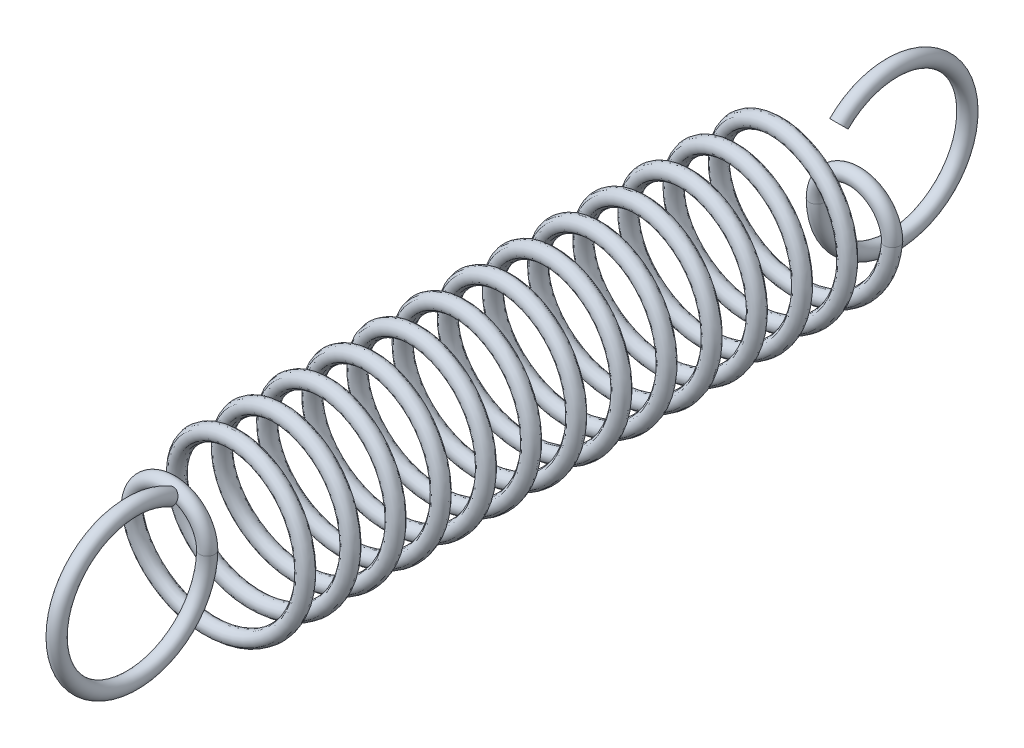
ISO-10303-21;
HEADER;
FILE_DESCRIPTION(('STEP AP214'),'2;1');
FILE_NAME('part.step','',(''),(''),'','','');
FILE_SCHEMA(('AUTOMOTIVE_DESIGN { 1 0 10303 214 1 1 1 1 }'));
ENDSEC;
DATA;
#1=APPLICATION_CONTEXT('core data for automotive mechanical design processes');
#2=APPLICATION_PROTOCOL_DEFINITION('international standard','automotive_design',2000,#1);
#3=PRODUCT_CONTEXT('',#1,'mechanical');
#4=PRODUCT('Part','Part','',(#3));
#5=PRODUCT_RELATED_PRODUCT_CATEGORY('part','',(#4));
#6=PRODUCT_DEFINITION_FORMATION('','',#4);
#7=PRODUCT_DEFINITION_CONTEXT('part definition',#1,'design');
#8=PRODUCT_DEFINITION('design','',#6,#7);
#9=PRODUCT_DEFINITION_SHAPE('','',#8);
#10=(LENGTH_UNIT() NAMED_UNIT(*) SI_UNIT(.MILLI.,.METRE.));
#11=(NAMED_UNIT(*) PLANE_ANGLE_UNIT() SI_UNIT($,.RADIAN.));
#12=(NAMED_UNIT(*) SI_UNIT($,.STERADIAN.) SOLID_ANGLE_UNIT());
#13=UNCERTAINTY_MEASURE_WITH_UNIT(LENGTH_MEASURE(1.E-05),#10,'distance_accuracy_value','');
#14=(GEOMETRIC_REPRESENTATION_CONTEXT(3) GLOBAL_UNCERTAINTY_ASSIGNED_CONTEXT((#13)) GLOBAL_UNIT_ASSIGNED_CONTEXT((#10,
#11,#12)) REPRESENTATION_CONTEXT('',''));
#15=CARTESIAN_POINT('',(0.,0.,0.));
#16=DIRECTION('',(0.,0.,1.));
#17=DIRECTION('',(1.,0.,0.));
#18=AXIS2_PLACEMENT_3D('',#15,#16,#17);
#19=CARTESIAN_POINT('',(4.99999999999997,0.,0.500000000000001));
#20=CARTESIAN_POINT('',(4.99999999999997,-2.88675134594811,0.75));
#21=CARTESIAN_POINT('',(2.49999999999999,-4.33012701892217,1.));
#22=CARTESIAN_POINT('',(0.,-5.77350269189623,1.25));
#23=CARTESIAN_POINT('',(-2.49999999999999,-4.33012701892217,1.5));
#24=CARTESIAN_POINT('',(-4.99999999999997,-2.88675134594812,1.75));
#25=CARTESIAN_POINT('',(-4.99999999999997,0.,2.));
#26=CARTESIAN_POINT('',(-4.99999999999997,2.88675134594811,2.25));
#27=CARTESIAN_POINT('',(-2.49999999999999,4.33012701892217,2.5));
#28=CARTESIAN_POINT('',(0.,5.77350269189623,2.75));
#29=CARTESIAN_POINT('',(2.49999999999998,4.33012701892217,2.99999999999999));
#30=CARTESIAN_POINT('',(4.99999999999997,2.88675134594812,3.24999999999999));
#31=CARTESIAN_POINT('',(4.99999999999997,0.,3.49999999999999));
#32=CARTESIAN_POINT('',(4.99999999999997,-2.88675134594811,3.74999999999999));
#33=CARTESIAN_POINT('',(2.49999999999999,-4.33012701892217,3.99999999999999));
#34=CARTESIAN_POINT('',(0.,-5.77350269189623,4.24999999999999));
#35=CARTESIAN_POINT('',(-2.49999999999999,-4.33012701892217,4.49999999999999));
#36=CARTESIAN_POINT('',(-4.99999999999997,-2.88675134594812,4.74999999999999));
#37=CARTESIAN_POINT('',(-4.99999999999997,0.,4.99999999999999));
#38=CARTESIAN_POINT('',(-4.99999999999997,2.88675134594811,5.24999999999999));
#39=CARTESIAN_POINT('',(-2.49999999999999,4.33012701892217,5.49999999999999));
#40=CARTESIAN_POINT('',(0.,5.77350269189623,5.74999999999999));
#41=CARTESIAN_POINT('',(2.49999999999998,4.33012701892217,5.99999999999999));
#42=CARTESIAN_POINT('',(4.99999999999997,2.88675134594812,6.24999999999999));
#43=CARTESIAN_POINT('',(4.99999999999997,0.,6.49999999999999));
#44=CARTESIAN_POINT('',(4.99999999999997,-2.88675134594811,6.74999999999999));
#45=CARTESIAN_POINT('',(2.49999999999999,-4.33012701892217,6.99999999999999));
#46=CARTESIAN_POINT('',(0.,-5.77350269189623,7.24999999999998));
#47=CARTESIAN_POINT('',(-2.49999999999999,-4.33012701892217,7.49999999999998));
#48=CARTESIAN_POINT('',(-4.99999999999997,-2.88675134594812,7.74999999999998));
#49=CARTESIAN_POINT('',(-4.99999999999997,0.,7.99999999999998));
#50=CARTESIAN_POINT('',(-4.99999999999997,2.88675134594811,8.24999999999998));
#51=CARTESIAN_POINT('',(-2.49999999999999,4.33012701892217,8.49999999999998));
#52=CARTESIAN_POINT('',(0.,5.77350269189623,8.74999999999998));
#53=CARTESIAN_POINT('',(2.49999999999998,4.33012701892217,8.99999999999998));
#54=CARTESIAN_POINT('',(4.99999999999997,2.88675134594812,9.24999999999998));
#55=CARTESIAN_POINT('',(4.99999999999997,0.,9.49999999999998));
#56=CARTESIAN_POINT('',(4.99999999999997,-2.88675134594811,9.74999999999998));
#57=CARTESIAN_POINT('',(2.49999999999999,-4.33012701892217,9.99999999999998));
#58=CARTESIAN_POINT('',(0.,-5.77350269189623,10.25));
#59=CARTESIAN_POINT('',(-2.49999999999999,-4.33012701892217,10.5));
#60=CARTESIAN_POINT('',(-4.99999999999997,-2.88675134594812,10.75));
#61=CARTESIAN_POINT('',(-4.99999999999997,0.,11.));
#62=CARTESIAN_POINT('',(-4.99999999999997,2.88675134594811,11.25));
#63=CARTESIAN_POINT('',(-2.49999999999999,4.33012701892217,11.5));
#64=CARTESIAN_POINT('',(0.,5.77350269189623,11.75));
#65=CARTESIAN_POINT('',(2.49999999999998,4.33012701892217,12.));
#66=CARTESIAN_POINT('',(4.99999999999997,2.88675134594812,12.25));
#67=CARTESIAN_POINT('',(4.99999999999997,0.,12.5));
#68=CARTESIAN_POINT('',(4.99999999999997,-2.88675134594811,12.75));
#69=CARTESIAN_POINT('',(2.49999999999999,-4.33012701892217,13.));
#70=CARTESIAN_POINT('',(0.,-5.77350269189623,13.25));
#71=CARTESIAN_POINT('',(-2.49999999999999,-4.33012701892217,13.5));
#72=CARTESIAN_POINT('',(-4.99999999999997,-2.88675134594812,13.75));
#73=CARTESIAN_POINT('',(-4.99999999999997,0.,14.));
#74=CARTESIAN_POINT('',(-4.99999999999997,2.88675134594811,14.25));
#75=CARTESIAN_POINT('',(-2.49999999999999,4.33012701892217,14.5));
#76=CARTESIAN_POINT('',(0.,5.77350269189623,14.75));
#77=CARTESIAN_POINT('',(2.49999999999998,4.33012701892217,15.));
#78=CARTESIAN_POINT('',(4.99999999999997,2.88675134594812,15.25));
#79=CARTESIAN_POINT('',(4.99999999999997,0.,15.5));
#80=CARTESIAN_POINT('',(4.99999999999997,-2.88675134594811,15.75));
#81=CARTESIAN_POINT('',(2.49999999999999,-4.33012701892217,16.));
#82=CARTESIAN_POINT('',(0.,-5.77350269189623,16.25));
#83=CARTESIAN_POINT('',(-2.49999999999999,-4.33012701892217,16.5));
#84=CARTESIAN_POINT('',(-4.99999999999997,-2.88675134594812,16.75));
#85=CARTESIAN_POINT('',(-4.99999999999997,0.,17.));
#86=CARTESIAN_POINT('',(-4.99999999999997,2.88675134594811,17.25));
#87=CARTESIAN_POINT('',(-2.49999999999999,4.33012701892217,17.5));
#88=CARTESIAN_POINT('',(0.,5.77350269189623,17.75));
#89=CARTESIAN_POINT('',(2.49999999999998,4.33012701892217,18.));
#90=CARTESIAN_POINT('',(4.99999999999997,2.88675134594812,18.25));
#91=CARTESIAN_POINT('',(4.99999999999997,0.,18.5));
#92=CARTESIAN_POINT('',(4.99999999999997,-2.88675134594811,18.75));
#93=CARTESIAN_POINT('',(2.49999999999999,-4.33012701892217,19.));
#94=CARTESIAN_POINT('',(0.,-5.77350269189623,19.25));
#95=CARTESIAN_POINT('',(-2.49999999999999,-4.33012701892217,19.5));
#96=CARTESIAN_POINT('',(-4.99999999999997,-2.88675134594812,19.75));
#97=CARTESIAN_POINT('',(-4.99999999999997,0.,20.));
#98=CARTESIAN_POINT('',(-4.99999999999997,2.88675134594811,20.25));
#99=CARTESIAN_POINT('',(-2.49999999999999,4.33012701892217,20.5));
#100=CARTESIAN_POINT('',(0.,5.77350269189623,20.75));
#101=CARTESIAN_POINT('',(2.49999999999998,4.33012701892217,21.));
#102=CARTESIAN_POINT('',(4.99999999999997,2.88675134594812,21.25));
#103=CARTESIAN_POINT('',(4.99999999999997,0.,21.5));
#104=CARTESIAN_POINT('',(4.99999999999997,-2.88675134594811,21.75));
#105=CARTESIAN_POINT('',(2.49999999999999,-4.33012701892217,22.));
#106=CARTESIAN_POINT('',(0.,-5.77350269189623,22.25));
#107=CARTESIAN_POINT('',(-2.49999999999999,-4.33012701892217,22.4999999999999));
#108=CARTESIAN_POINT('',(-4.99999999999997,-2.88675134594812,22.7499999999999));
#109=CARTESIAN_POINT('',(-4.99999999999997,0.,22.9999999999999));
#110=CARTESIAN_POINT('',(-4.99999999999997,2.88675134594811,23.2499999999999));
#111=CARTESIAN_POINT('',(-2.49999999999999,4.33012701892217,23.4999999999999));
#112=CARTESIAN_POINT('',(0.,5.77350269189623,23.7499999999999));
#113=CARTESIAN_POINT('',(2.49999999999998,4.33012701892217,23.9999999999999));
#114=CARTESIAN_POINT('',(4.99999999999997,2.88675134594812,24.2499999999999));
#115=CARTESIAN_POINT('',(4.99999999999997,0.,24.4999999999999));
#116=CARTESIAN_POINT('',(4.99999999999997,-2.88675134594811,24.7499999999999));
#117=CARTESIAN_POINT('',(2.49999999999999,-4.33012701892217,24.9999999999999));
#118=CARTESIAN_POINT('',(0.,-5.77350269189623,25.2499999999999));
#119=CARTESIAN_POINT('',(-2.49999999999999,-4.33012701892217,25.4999999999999));
#120=CARTESIAN_POINT('',(-4.99999999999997,-2.88675134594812,25.7499999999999));
#121=CARTESIAN_POINT('',(-4.99999999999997,0.,25.9999999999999));
#122=CARTESIAN_POINT('',(-4.99999999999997,2.88675134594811,26.2499999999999));
#123=CARTESIAN_POINT('',(-2.49999999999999,4.33012701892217,26.4999999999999));
#124=CARTESIAN_POINT('',(0.,5.77350269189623,26.7499999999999));
#125=CARTESIAN_POINT('',(2.49999999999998,4.33012701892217,26.9999999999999));
#126=CARTESIAN_POINT('',(4.99999999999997,2.88675134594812,27.2499999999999));
#127=CARTESIAN_POINT('',(4.99999999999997,0.,27.4999999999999));
#128=CARTESIAN_POINT('',(4.99999999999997,-2.88675134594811,27.7499999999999));
#129=CARTESIAN_POINT('',(2.49999999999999,-4.33012701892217,27.9999999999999));
#130=CARTESIAN_POINT('',(0.,-5.77350269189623,28.2499999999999));
#131=CARTESIAN_POINT('',(-2.49999999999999,-4.33012701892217,28.4999999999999));
#132=CARTESIAN_POINT('',(-4.99999999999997,-2.88675134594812,28.7499999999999));
#133=CARTESIAN_POINT('',(-4.99999999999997,0.,28.9999999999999));
#134=CARTESIAN_POINT('',(-4.99999999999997,2.88675134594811,29.2499999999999));
#135=CARTESIAN_POINT('',(-2.49999999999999,4.33012701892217,29.4999999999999));
#136=CARTESIAN_POINT('',(0.,5.77350269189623,29.7499999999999));
#137=CARTESIAN_POINT('',(2.49999999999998,4.33012701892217,29.9999999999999));
#138=CARTESIAN_POINT('',(4.99999999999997,2.88675134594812,30.2499999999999));
#139=CARTESIAN_POINT('',(4.99999999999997,0.,30.4999999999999));
#140=CARTESIAN_POINT('',(4.99999999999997,-2.88675134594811,30.7499999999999));
#141=CARTESIAN_POINT('',(2.49999999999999,-4.33012701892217,30.9999999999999));
#142=CARTESIAN_POINT('',(0.,-5.77350269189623,31.2499999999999));
#143=CARTESIAN_POINT('',(-2.49999999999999,-4.33012701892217,31.4999999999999));
#144=CARTESIAN_POINT('',(-4.99999999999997,-2.88675134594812,31.7499999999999));
#145=CARTESIAN_POINT('',(-4.99999999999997,0.,31.9999999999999));
#146=CARTESIAN_POINT('',(-4.99999999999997,2.88675134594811,32.2499999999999));
#147=CARTESIAN_POINT('',(-2.49999999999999,4.33012701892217,32.4999999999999));
#148=CARTESIAN_POINT('',(0.,5.77350269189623,32.7499999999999));
#149=CARTESIAN_POINT('',(2.49999999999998,4.33012701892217,32.9999999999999));
#150=CARTESIAN_POINT('',(4.99999999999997,2.88675134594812,33.2499999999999));
#151=CARTESIAN_POINT('',(4.99999999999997,0.,33.4999999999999));
#152=CARTESIAN_POINT('',(4.99999999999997,-2.88675134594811,33.7499999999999));
#153=CARTESIAN_POINT('',(2.49999999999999,-4.33012701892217,33.9999999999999));
#154=CARTESIAN_POINT('',(0.,-5.77350269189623,34.2499999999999));
#155=CARTESIAN_POINT('',(-2.49999999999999,-4.33012701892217,34.4999999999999));
#156=CARTESIAN_POINT('',(-4.99999999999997,-2.88675134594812,34.7499999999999));
#157=CARTESIAN_POINT('',(-4.99999999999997,0.,34.9999999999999));
#158=CARTESIAN_POINT('',(-4.99999999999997,2.88675134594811,35.2499999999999));
#159=CARTESIAN_POINT('',(-2.49999999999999,4.33012701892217,35.4999999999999));
#160=CARTESIAN_POINT('',(0.,5.77350269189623,35.7499999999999));
#161=CARTESIAN_POINT('',(2.49999999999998,4.33012701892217,35.9999999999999));
#162=CARTESIAN_POINT('',(4.99999999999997,2.88675134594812,36.2499999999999));
#163=CARTESIAN_POINT('',(4.99999999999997,0.,36.4999999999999));
#164=CARTESIAN_POINT('',(4.99999999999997,-2.88675134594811,36.7499999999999));
#165=CARTESIAN_POINT('',(2.49999999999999,-4.33012701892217,36.9999999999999));
#166=CARTESIAN_POINT('',(0.,-5.77350269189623,37.2499999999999));
#167=CARTESIAN_POINT('',(-2.49999999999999,-4.33012701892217,37.4999999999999));
#168=CARTESIAN_POINT('',(-4.99999999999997,-2.88675134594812,37.7499999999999));
#169=CARTESIAN_POINT('',(-4.99999999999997,0.,37.9999999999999));
#170=CARTESIAN_POINT('',(-4.99999999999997,2.88675134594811,38.2499999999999));
#171=CARTESIAN_POINT('',(-2.49999999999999,4.33012701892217,38.4999999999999));
#172=CARTESIAN_POINT('',(0.,5.77350269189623,38.7499999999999));
#173=CARTESIAN_POINT('',(2.49999999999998,4.33012701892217,38.9999999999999));
#174=CARTESIAN_POINT('',(4.99999999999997,2.88675134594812,39.2499999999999));
#175=CARTESIAN_POINT('',(4.99999999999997,0.,39.4999999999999));
#176=CARTESIAN_POINT('',(4.99999999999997,-2.88675134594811,39.7499999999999));
#177=CARTESIAN_POINT('',(2.49999999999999,-4.33012701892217,39.9999999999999));
#178=CARTESIAN_POINT('',(0.,-5.77350269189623,40.2499999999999));
#179=CARTESIAN_POINT('',(-2.49999999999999,-4.33012701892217,40.4999999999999));
#180=CARTESIAN_POINT('',(-4.99999999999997,-2.88675134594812,40.7499999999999));
#181=CARTESIAN_POINT('',(-4.99999999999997,0.,40.9999999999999));
#182=CARTESIAN_POINT('',(-4.99999999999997,2.88675134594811,41.2499999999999));
#183=CARTESIAN_POINT('',(-2.49999999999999,4.33012701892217,41.4999999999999));
#184=CARTESIAN_POINT('',(0.,5.77350269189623,41.7499999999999));
#185=CARTESIAN_POINT('',(2.49999999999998,4.33012701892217,41.9999999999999));
#186=CARTESIAN_POINT('',(4.99999999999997,2.88675134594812,42.2499999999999));
#187=CARTESIAN_POINT('',(4.99999999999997,0.,42.4999999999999));
#188=CARTESIAN_POINT('',(5.99999999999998,0.,0.500000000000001));
#189=CARTESIAN_POINT('',(5.99999999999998,-3.46410161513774,0.75));
#190=CARTESIAN_POINT('',(2.99999999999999,-5.19615242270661,1.));
#191=CARTESIAN_POINT('',(0.,-6.92820323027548,1.25));
#192=CARTESIAN_POINT('',(-2.99999999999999,-5.19615242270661,1.5));
#193=CARTESIAN_POINT('',(-5.99999999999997,-3.46410161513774,1.75));
#194=CARTESIAN_POINT('',(-5.99999999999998,0.,2.));
#195=CARTESIAN_POINT('',(-5.99999999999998,3.46410161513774,2.25));
#196=CARTESIAN_POINT('',(-2.99999999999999,5.19615242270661,2.5));
#197=CARTESIAN_POINT('',(0.,6.92820323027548,2.75));
#198=CARTESIAN_POINT('',(2.99999999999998,5.19615242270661,3.));
#199=CARTESIAN_POINT('',(5.99999999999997,3.46410161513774,3.24999999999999));
#200=CARTESIAN_POINT('',(5.99999999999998,0.,3.49999999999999));
#201=CARTESIAN_POINT('',(5.99999999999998,-3.46410161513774,3.74999999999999));
#202=CARTESIAN_POINT('',(2.99999999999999,-5.19615242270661,3.99999999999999));
#203=CARTESIAN_POINT('',(0.,-6.92820323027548,4.24999999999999));
#204=CARTESIAN_POINT('',(-2.99999999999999,-5.19615242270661,4.49999999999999));
#205=CARTESIAN_POINT('',(-5.99999999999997,-3.46410161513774,4.74999999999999));
#206=CARTESIAN_POINT('',(-5.99999999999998,0.,4.99999999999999));
#207=CARTESIAN_POINT('',(-5.99999999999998,3.46410161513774,5.24999999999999));
#208=CARTESIAN_POINT('',(-2.99999999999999,5.19615242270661,5.49999999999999));
#209=CARTESIAN_POINT('',(0.,6.92820323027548,5.74999999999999));
#210=CARTESIAN_POINT('',(2.99999999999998,5.19615242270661,5.99999999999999));
#211=CARTESIAN_POINT('',(5.99999999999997,3.46410161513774,6.24999999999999));
#212=CARTESIAN_POINT('',(5.99999999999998,0.,6.49999999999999));
#213=CARTESIAN_POINT('',(5.99999999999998,-3.46410161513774,6.74999999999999));
#214=CARTESIAN_POINT('',(2.99999999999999,-5.19615242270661,6.99999999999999));
#215=CARTESIAN_POINT('',(0.,-6.92820323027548,7.24999999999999));
#216=CARTESIAN_POINT('',(-2.99999999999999,-5.19615242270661,7.49999999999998));
#217=CARTESIAN_POINT('',(-5.99999999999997,-3.46410161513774,7.74999999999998));
#218=CARTESIAN_POINT('',(-5.99999999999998,0.,7.99999999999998));
#219=CARTESIAN_POINT('',(-5.99999999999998,3.46410161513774,8.24999999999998));
#220=CARTESIAN_POINT('',(-2.99999999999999,5.19615242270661,8.49999999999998));
#221=CARTESIAN_POINT('',(0.,6.92820323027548,8.74999999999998));
#222=CARTESIAN_POINT('',(2.99999999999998,5.19615242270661,8.99999999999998));
#223=CARTESIAN_POINT('',(5.99999999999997,3.46410161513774,9.24999999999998));
#224=CARTESIAN_POINT('',(5.99999999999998,0.,9.49999999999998));
#225=CARTESIAN_POINT('',(5.99999999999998,-3.46410161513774,9.74999999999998));
#226=CARTESIAN_POINT('',(2.99999999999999,-5.19615242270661,9.99999999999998));
#227=CARTESIAN_POINT('',(0.,-6.92820323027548,10.25));
#228=CARTESIAN_POINT('',(-2.99999999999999,-5.19615242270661,10.5));
#229=CARTESIAN_POINT('',(-5.99999999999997,-3.46410161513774,10.75));
#230=CARTESIAN_POINT('',(-5.99999999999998,0.,11.));
#231=CARTESIAN_POINT('',(-5.99999999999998,3.46410161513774,11.25));
#232=CARTESIAN_POINT('',(-2.99999999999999,5.19615242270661,11.5));
#233=CARTESIAN_POINT('',(0.,6.92820323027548,11.75));
#234=CARTESIAN_POINT('',(2.99999999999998,5.19615242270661,12.));
#235=CARTESIAN_POINT('',(5.99999999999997,3.46410161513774,12.25));
#236=CARTESIAN_POINT('',(5.99999999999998,0.,12.5));
#237=CARTESIAN_POINT('',(5.99999999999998,-3.46410161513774,12.75));
#238=CARTESIAN_POINT('',(2.99999999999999,-5.19615242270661,13.));
#239=CARTESIAN_POINT('',(0.,-6.92820323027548,13.25));
#240=CARTESIAN_POINT('',(-2.99999999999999,-5.19615242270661,13.5));
#241=CARTESIAN_POINT('',(-5.99999999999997,-3.46410161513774,13.75));
#242=CARTESIAN_POINT('',(-5.99999999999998,0.,14.));
#243=CARTESIAN_POINT('',(-5.99999999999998,3.46410161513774,14.25));
#244=CARTESIAN_POINT('',(-2.99999999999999,5.19615242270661,14.5));
#245=CARTESIAN_POINT('',(0.,6.92820323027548,14.75));
#246=CARTESIAN_POINT('',(2.99999999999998,5.19615242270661,15.));
#247=CARTESIAN_POINT('',(5.99999999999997,3.46410161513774,15.25));
#248=CARTESIAN_POINT('',(5.99999999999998,0.,15.5));
#249=CARTESIAN_POINT('',(5.99999999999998,-3.46410161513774,15.75));
#250=CARTESIAN_POINT('',(2.99999999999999,-5.19615242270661,16.));
#251=CARTESIAN_POINT('',(0.,-6.92820323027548,16.25));
#252=CARTESIAN_POINT('',(-2.99999999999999,-5.19615242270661,16.5));
#253=CARTESIAN_POINT('',(-5.99999999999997,-3.46410161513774,16.75));
#254=CARTESIAN_POINT('',(-5.99999999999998,0.,17.));
#255=CARTESIAN_POINT('',(-5.99999999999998,3.46410161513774,17.25));
#256=CARTESIAN_POINT('',(-2.99999999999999,5.19615242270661,17.5));
#257=CARTESIAN_POINT('',(0.,6.92820323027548,17.75));
#258=CARTESIAN_POINT('',(2.99999999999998,5.19615242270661,18.));
#259=CARTESIAN_POINT('',(5.99999999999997,3.46410161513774,18.25));
#260=CARTESIAN_POINT('',(5.99999999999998,0.,18.5));
#261=CARTESIAN_POINT('',(5.99999999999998,-3.46410161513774,18.75));
#262=CARTESIAN_POINT('',(2.99999999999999,-5.19615242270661,19.));
#263=CARTESIAN_POINT('',(0.,-6.92820323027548,19.25));
#264=CARTESIAN_POINT('',(-2.99999999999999,-5.19615242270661,19.5));
#265=CARTESIAN_POINT('',(-5.99999999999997,-3.46410161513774,19.75));
#266=CARTESIAN_POINT('',(-5.99999999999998,0.,20.));
#267=CARTESIAN_POINT('',(-5.99999999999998,3.46410161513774,20.25));
#268=CARTESIAN_POINT('',(-2.99999999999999,5.19615242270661,20.5));
#269=CARTESIAN_POINT('',(0.,6.92820323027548,20.75));
#270=CARTESIAN_POINT('',(2.99999999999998,5.19615242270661,21.));
#271=CARTESIAN_POINT('',(5.99999999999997,3.46410161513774,21.25));
#272=CARTESIAN_POINT('',(5.99999999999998,0.,21.5));
#273=CARTESIAN_POINT('',(5.99999999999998,-3.46410161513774,21.75));
#274=CARTESIAN_POINT('',(2.99999999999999,-5.19615242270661,22.));
#275=CARTESIAN_POINT('',(0.,-6.92820323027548,22.25));
#276=CARTESIAN_POINT('',(-2.99999999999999,-5.19615242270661,22.4999999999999));
#277=CARTESIAN_POINT('',(-5.99999999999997,-3.46410161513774,22.75));
#278=CARTESIAN_POINT('',(-5.99999999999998,0.,22.9999999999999));
#279=CARTESIAN_POINT('',(-5.99999999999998,3.46410161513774,23.25));
#280=CARTESIAN_POINT('',(-2.99999999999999,5.19615242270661,23.4999999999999));
#281=CARTESIAN_POINT('',(0.,6.92820323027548,23.7499999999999));
#282=CARTESIAN_POINT('',(2.99999999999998,5.19615242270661,23.9999999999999));
#283=CARTESIAN_POINT('',(5.99999999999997,3.46410161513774,24.2499999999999));
#284=CARTESIAN_POINT('',(5.99999999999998,0.,24.5));
#285=CARTESIAN_POINT('',(5.99999999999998,-3.46410161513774,24.7499999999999));
#286=CARTESIAN_POINT('',(2.99999999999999,-5.19615242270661,24.9999999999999));
#287=CARTESIAN_POINT('',(0.,-6.92820323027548,25.2499999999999));
#288=CARTESIAN_POINT('',(-2.99999999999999,-5.19615242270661,25.4999999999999));
#289=CARTESIAN_POINT('',(-5.99999999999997,-3.46410161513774,25.7499999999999));
#290=CARTESIAN_POINT('',(-5.99999999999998,0.,25.9999999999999));
#291=CARTESIAN_POINT('',(-5.99999999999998,3.46410161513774,26.2499999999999));
#292=CARTESIAN_POINT('',(-2.99999999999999,5.19615242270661,26.4999999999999));
#293=CARTESIAN_POINT('',(0.,6.92820323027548,26.7499999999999));
#294=CARTESIAN_POINT('',(2.99999999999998,5.19615242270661,26.9999999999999));
#295=CARTESIAN_POINT('',(5.99999999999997,3.46410161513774,27.2499999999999));
#296=CARTESIAN_POINT('',(5.99999999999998,0.,27.4999999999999));
#297=CARTESIAN_POINT('',(5.99999999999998,-3.46410161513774,27.7499999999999));
#298=CARTESIAN_POINT('',(2.99999999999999,-5.19615242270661,27.9999999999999));
#299=CARTESIAN_POINT('',(0.,-6.92820323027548,28.2499999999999));
#300=CARTESIAN_POINT('',(-2.99999999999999,-5.19615242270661,28.4999999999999));
#301=CARTESIAN_POINT('',(-5.99999999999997,-3.46410161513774,28.7499999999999));
#302=CARTESIAN_POINT('',(-5.99999999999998,0.,28.9999999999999));
#303=CARTESIAN_POINT('',(-5.99999999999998,3.46410161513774,29.2499999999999));
#304=CARTESIAN_POINT('',(-2.99999999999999,5.19615242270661,29.4999999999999));
#305=CARTESIAN_POINT('',(0.,6.92820323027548,29.7499999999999));
#306=CARTESIAN_POINT('',(2.99999999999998,5.19615242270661,29.9999999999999));
#307=CARTESIAN_POINT('',(5.99999999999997,3.46410161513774,30.2499999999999));
#308=CARTESIAN_POINT('',(5.99999999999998,0.,30.4999999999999));
#309=CARTESIAN_POINT('',(5.99999999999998,-3.46410161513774,30.7499999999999));
#310=CARTESIAN_POINT('',(2.99999999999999,-5.19615242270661,30.9999999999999));
#311=CARTESIAN_POINT('',(0.,-6.92820323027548,31.2499999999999));
#312=CARTESIAN_POINT('',(-2.99999999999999,-5.19615242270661,31.4999999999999));
#313=CARTESIAN_POINT('',(-5.99999999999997,-3.46410161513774,31.7499999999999));
#314=CARTESIAN_POINT('',(-5.99999999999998,0.,31.9999999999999));
#315=CARTESIAN_POINT('',(-5.99999999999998,3.46410161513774,32.2499999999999));
#316=CARTESIAN_POINT('',(-2.99999999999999,5.19615242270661,32.4999999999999));
#317=CARTESIAN_POINT('',(0.,6.92820323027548,32.7499999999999));
#318=CARTESIAN_POINT('',(2.99999999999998,5.19615242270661,32.9999999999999));
#319=CARTESIAN_POINT('',(5.99999999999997,3.46410161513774,33.2499999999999));
#320=CARTESIAN_POINT('',(5.99999999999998,0.,33.4999999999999));
#321=CARTESIAN_POINT('',(5.99999999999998,-3.46410161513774,33.7499999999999));
#322=CARTESIAN_POINT('',(2.99999999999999,-5.19615242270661,33.9999999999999));
#323=CARTESIAN_POINT('',(0.,-6.92820323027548,34.2499999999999));
#324=CARTESIAN_POINT('',(-2.99999999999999,-5.19615242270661,34.4999999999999));
#325=CARTESIAN_POINT('',(-5.99999999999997,-3.46410161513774,34.7499999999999));
#326=CARTESIAN_POINT('',(-5.99999999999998,0.,34.9999999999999));
#327=CARTESIAN_POINT('',(-5.99999999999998,3.46410161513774,35.2499999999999));
#328=CARTESIAN_POINT('',(-2.99999999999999,5.19615242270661,35.4999999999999));
#329=CARTESIAN_POINT('',(0.,6.92820323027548,35.7499999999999));
#330=CARTESIAN_POINT('',(2.99999999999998,5.19615242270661,35.9999999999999));
#331=CARTESIAN_POINT('',(5.99999999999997,3.46410161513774,36.2499999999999));
#332=CARTESIAN_POINT('',(5.99999999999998,0.,36.4999999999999));
#333=CARTESIAN_POINT('',(5.99999999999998,-3.46410161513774,36.7499999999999));
#334=CARTESIAN_POINT('',(2.99999999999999,-5.19615242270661,36.9999999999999));
#335=CARTESIAN_POINT('',(0.,-6.92820323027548,37.2499999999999));
#336=CARTESIAN_POINT('',(-2.99999999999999,-5.19615242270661,37.4999999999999));
#337=CARTESIAN_POINT('',(-5.99999999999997,-3.46410161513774,37.7499999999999));
#338=CARTESIAN_POINT('',(-5.99999999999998,0.,37.9999999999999));
#339=CARTESIAN_POINT('',(-5.99999999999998,3.46410161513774,38.2499999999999));
#340=CARTESIAN_POINT('',(-2.99999999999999,5.19615242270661,38.4999999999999));
#341=CARTESIAN_POINT('',(0.,6.92820323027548,38.7499999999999));
#342=CARTESIAN_POINT('',(2.99999999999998,5.19615242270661,38.9999999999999));
#343=CARTESIAN_POINT('',(5.99999999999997,3.46410161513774,39.2499999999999));
#344=CARTESIAN_POINT('',(5.99999999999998,0.,39.4999999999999));
#345=CARTESIAN_POINT('',(5.99999999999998,-3.46410161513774,39.7499999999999));
#346=CARTESIAN_POINT('',(2.99999999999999,-5.19615242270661,39.9999999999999));
#347=CARTESIAN_POINT('',(0.,-6.92820323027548,40.2499999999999));
#348=CARTESIAN_POINT('',(-2.99999999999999,-5.19615242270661,40.4999999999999));
#349=CARTESIAN_POINT('',(-5.99999999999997,-3.46410161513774,40.7499999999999));
#350=CARTESIAN_POINT('',(-5.99999999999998,0.,40.9999999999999));
#351=CARTESIAN_POINT('',(-5.99999999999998,3.46410161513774,41.2499999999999));
#352=CARTESIAN_POINT('',(-2.99999999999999,5.19615242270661,41.4999999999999));
#353=CARTESIAN_POINT('',(0.,6.92820323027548,41.7499999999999));
#354=CARTESIAN_POINT('',(2.99999999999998,5.19615242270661,41.9999999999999));
#355=CARTESIAN_POINT('',(5.99999999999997,3.46410161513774,42.2499999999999));
#356=CARTESIAN_POINT('',(5.99999999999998,0.,42.4999999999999));
#357=CARTESIAN_POINT('',(5.99999999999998,0.,-0.500000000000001));
#358=CARTESIAN_POINT('',(5.99999999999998,-3.46410161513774,-0.250000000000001));
#359=CARTESIAN_POINT('',(2.99999999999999,-5.19615242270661,0.));
#360=CARTESIAN_POINT('',(0.,-6.92820323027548,0.249999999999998));
#361=CARTESIAN_POINT('',(-2.99999999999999,-5.19615242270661,0.499999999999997));
#362=CARTESIAN_POINT('',(-5.99999999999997,-3.46410161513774,0.749999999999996));
#363=CARTESIAN_POINT('',(-5.99999999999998,0.,0.999999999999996));
#364=CARTESIAN_POINT('',(-5.99999999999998,3.46410161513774,1.25));
#365=CARTESIAN_POINT('',(-2.99999999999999,5.19615242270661,1.49999999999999));
#366=CARTESIAN_POINT('',(0.,6.92820323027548,1.74999999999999));
#367=CARTESIAN_POINT('',(2.99999999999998,5.19615242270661,1.99999999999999));
#368=CARTESIAN_POINT('',(5.99999999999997,3.46410161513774,2.24999999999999));
#369=CARTESIAN_POINT('',(5.99999999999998,0.,2.49999999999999));
#370=CARTESIAN_POINT('',(5.99999999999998,-3.46410161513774,2.74999999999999));
#371=CARTESIAN_POINT('',(2.99999999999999,-5.19615242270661,2.99999999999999));
#372=CARTESIAN_POINT('',(0.,-6.92820323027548,3.24999999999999));
#373=CARTESIAN_POINT('',(-2.99999999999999,-5.19615242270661,3.49999999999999));
#374=CARTESIAN_POINT('',(-5.99999999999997,-3.46410161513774,3.74999999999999));
#375=CARTESIAN_POINT('',(-5.99999999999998,0.,3.99999999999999));
#376=CARTESIAN_POINT('',(-5.99999999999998,3.46410161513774,4.24999999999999));
#377=CARTESIAN_POINT('',(-2.99999999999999,5.19615242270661,4.49999999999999));
#378=CARTESIAN_POINT('',(0.,6.92820323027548,4.74999999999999));
#379=CARTESIAN_POINT('',(2.99999999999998,5.19615242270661,4.99999999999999));
#380=CARTESIAN_POINT('',(5.99999999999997,3.46410161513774,5.24999999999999));
#381=CARTESIAN_POINT('',(5.99999999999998,0.,5.49999999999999));
#382=CARTESIAN_POINT('',(5.99999999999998,-3.46410161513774,5.74999999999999));
#383=CARTESIAN_POINT('',(2.99999999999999,-5.19615242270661,5.99999999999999));
#384=CARTESIAN_POINT('',(0.,-6.92820323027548,6.24999999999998));
#385=CARTESIAN_POINT('',(-2.99999999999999,-5.19615242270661,6.49999999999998));
#386=CARTESIAN_POINT('',(-5.99999999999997,-3.46410161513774,6.74999999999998));
#387=CARTESIAN_POINT('',(-5.99999999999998,0.,6.99999999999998));
#388=CARTESIAN_POINT('',(-5.99999999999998,3.46410161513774,7.24999999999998));
#389=CARTESIAN_POINT('',(-2.99999999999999,5.19615242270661,7.49999999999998));
#390=CARTESIAN_POINT('',(0.,6.92820323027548,7.74999999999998));
#391=CARTESIAN_POINT('',(2.99999999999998,5.19615242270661,7.99999999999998));
#392=CARTESIAN_POINT('',(5.99999999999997,3.46410161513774,8.24999999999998));
#393=CARTESIAN_POINT('',(5.99999999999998,0.,8.49999999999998));
#394=CARTESIAN_POINT('',(5.99999999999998,-3.46410161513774,8.74999999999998));
#395=CARTESIAN_POINT('',(2.99999999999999,-5.19615242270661,8.99999999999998));
#396=CARTESIAN_POINT('',(0.,-6.92820323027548,9.24999999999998));
#397=CARTESIAN_POINT('',(-2.99999999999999,-5.19615242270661,9.49999999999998));
#398=CARTESIAN_POINT('',(-5.99999999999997,-3.46410161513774,9.74999999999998));
#399=CARTESIAN_POINT('',(-5.99999999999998,0.,9.99999999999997));
#400=CARTESIAN_POINT('',(-5.99999999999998,3.46410161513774,10.25));
#401=CARTESIAN_POINT('',(-2.99999999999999,5.19615242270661,10.5));
#402=CARTESIAN_POINT('',(0.,6.92820323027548,10.75));
#403=CARTESIAN_POINT('',(2.99999999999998,5.19615242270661,11.));
#404=CARTESIAN_POINT('',(5.99999999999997,3.46410161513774,11.25));
#405=CARTESIAN_POINT('',(5.99999999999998,0.,11.5));
#406=CARTESIAN_POINT('',(5.99999999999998,-3.46410161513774,11.75));
#407=CARTESIAN_POINT('',(2.99999999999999,-5.19615242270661,12.));
#408=CARTESIAN_POINT('',(0.,-6.92820323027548,12.25));
#409=CARTESIAN_POINT('',(-2.99999999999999,-5.19615242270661,12.5));
#410=CARTESIAN_POINT('',(-5.99999999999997,-3.46410161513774,12.75));
#411=CARTESIAN_POINT('',(-5.99999999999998,0.,13.));
#412=CARTESIAN_POINT('',(-5.99999999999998,3.46410161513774,13.25));
#413=CARTESIAN_POINT('',(-2.99999999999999,5.19615242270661,13.5));
#414=CARTESIAN_POINT('',(0.,6.92820323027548,13.75));
#415=CARTESIAN_POINT('',(2.99999999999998,5.19615242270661,14.));
#416=CARTESIAN_POINT('',(5.99999999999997,3.46410161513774,14.25));
#417=CARTESIAN_POINT('',(5.99999999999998,0.,14.5));
#418=CARTESIAN_POINT('',(5.99999999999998,-3.46410161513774,14.75));
#419=CARTESIAN_POINT('',(2.99999999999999,-5.19615242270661,15.));
#420=CARTESIAN_POINT('',(0.,-6.92820323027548,15.25));
#421=CARTESIAN_POINT('',(-2.99999999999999,-5.19615242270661,15.5));
#422=CARTESIAN_POINT('',(-5.99999999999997,-3.46410161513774,15.75));
#423=CARTESIAN_POINT('',(-5.99999999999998,0.,16.));
#424=CARTESIAN_POINT('',(-5.99999999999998,3.46410161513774,16.25));
#425=CARTESIAN_POINT('',(-2.99999999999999,5.19615242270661,16.5));
#426=CARTESIAN_POINT('',(0.,6.92820323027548,16.75));
#427=CARTESIAN_POINT('',(2.99999999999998,5.19615242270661,17.));
#428=CARTESIAN_POINT('',(5.99999999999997,3.46410161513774,17.25));
#429=CARTESIAN_POINT('',(5.99999999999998,0.,17.5));
#430=CARTESIAN_POINT('',(5.99999999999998,-3.46410161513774,17.75));
#431=CARTESIAN_POINT('',(2.99999999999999,-5.19615242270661,18.));
#432=CARTESIAN_POINT('',(0.,-6.92820323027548,18.25));
#433=CARTESIAN_POINT('',(-2.99999999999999,-5.19615242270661,18.5));
#434=CARTESIAN_POINT('',(-5.99999999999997,-3.46410161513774,18.75));
#435=CARTESIAN_POINT('',(-5.99999999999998,0.,19.));
#436=CARTESIAN_POINT('',(-5.99999999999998,3.46410161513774,19.25));
#437=CARTESIAN_POINT('',(-2.99999999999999,5.19615242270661,19.5));
#438=CARTESIAN_POINT('',(0.,6.92820323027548,19.75));
#439=CARTESIAN_POINT('',(2.99999999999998,5.19615242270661,20.));
#440=CARTESIAN_POINT('',(5.99999999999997,3.46410161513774,20.25));
#441=CARTESIAN_POINT('',(5.99999999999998,0.,20.5));
#442=CARTESIAN_POINT('',(5.99999999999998,-3.46410161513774,20.75));
#443=CARTESIAN_POINT('',(2.99999999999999,-5.19615242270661,21.));
#444=CARTESIAN_POINT('',(0.,-6.92820323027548,21.25));
#445=CARTESIAN_POINT('',(-2.99999999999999,-5.19615242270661,21.4999999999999));
#446=CARTESIAN_POINT('',(-5.99999999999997,-3.46410161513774,21.75));
#447=CARTESIAN_POINT('',(-5.99999999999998,0.,21.9999999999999));
#448=CARTESIAN_POINT('',(-5.99999999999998,3.46410161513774,22.2499999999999));
#449=CARTESIAN_POINT('',(-2.99999999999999,5.19615242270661,22.4999999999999));
#450=CARTESIAN_POINT('',(0.,6.92820323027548,22.7499999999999));
#451=CARTESIAN_POINT('',(2.99999999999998,5.19615242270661,22.9999999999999));
#452=CARTESIAN_POINT('',(5.99999999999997,3.46410161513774,23.2499999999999));
#453=CARTESIAN_POINT('',(5.99999999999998,0.,23.4999999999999));
#454=CARTESIAN_POINT('',(5.99999999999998,-3.46410161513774,23.7499999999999));
#455=CARTESIAN_POINT('',(2.99999999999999,-5.19615242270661,23.9999999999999));
#456=CARTESIAN_POINT('',(0.,-6.92820323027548,24.2499999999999));
#457=CARTESIAN_POINT('',(-2.99999999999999,-5.19615242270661,24.4999999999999));
#458=CARTESIAN_POINT('',(-5.99999999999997,-3.46410161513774,24.7499999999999));
#459=CARTESIAN_POINT('',(-5.99999999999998,0.,24.9999999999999));
#460=CARTESIAN_POINT('',(-5.99999999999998,3.46410161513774,25.2499999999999));
#461=CARTESIAN_POINT('',(-2.99999999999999,5.19615242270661,25.4999999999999));
#462=CARTESIAN_POINT('',(0.,6.92820323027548,25.7499999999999));
#463=CARTESIAN_POINT('',(2.99999999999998,5.19615242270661,25.9999999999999));
#464=CARTESIAN_POINT('',(5.99999999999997,3.46410161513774,26.2499999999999));
#465=CARTESIAN_POINT('',(5.99999999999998,0.,26.4999999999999));
#466=CARTESIAN_POINT('',(5.99999999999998,-3.46410161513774,26.7499999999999));
#467=CARTESIAN_POINT('',(2.99999999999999,-5.19615242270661,26.9999999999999));
#468=CARTESIAN_POINT('',(0.,-6.92820323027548,27.2499999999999));
#469=CARTESIAN_POINT('',(-2.99999999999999,-5.19615242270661,27.4999999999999));
#470=CARTESIAN_POINT('',(-5.99999999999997,-3.46410161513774,27.7499999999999));
#471=CARTESIAN_POINT('',(-5.99999999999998,0.,27.9999999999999));
#472=CARTESIAN_POINT('',(-5.99999999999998,3.46410161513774,28.2499999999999));
#473=CARTESIAN_POINT('',(-2.99999999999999,5.19615242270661,28.4999999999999));
#474=CARTESIAN_POINT('',(0.,6.92820323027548,28.7499999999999));
#475=CARTESIAN_POINT('',(2.99999999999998,5.19615242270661,28.9999999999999));
#476=CARTESIAN_POINT('',(5.99999999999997,3.46410161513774,29.2499999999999));
#477=CARTESIAN_POINT('',(5.99999999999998,0.,29.4999999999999));
#478=CARTESIAN_POINT('',(5.99999999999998,-3.46410161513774,29.7499999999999));
#479=CARTESIAN_POINT('',(2.99999999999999,-5.19615242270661,29.9999999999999));
#480=CARTESIAN_POINT('',(0.,-6.92820323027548,30.2499999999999));
#481=CARTESIAN_POINT('',(-2.99999999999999,-5.19615242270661,30.4999999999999));
#482=CARTESIAN_POINT('',(-5.99999999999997,-3.46410161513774,30.7499999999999));
#483=CARTESIAN_POINT('',(-5.99999999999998,0.,30.9999999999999));
#484=CARTESIAN_POINT('',(-5.99999999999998,3.46410161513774,31.2499999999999));
#485=CARTESIAN_POINT('',(-2.99999999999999,5.19615242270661,31.4999999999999));
#486=CARTESIAN_POINT('',(0.,6.92820323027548,31.7499999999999));
#487=CARTESIAN_POINT('',(2.99999999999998,5.19615242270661,31.9999999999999));
#488=CARTESIAN_POINT('',(5.99999999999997,3.46410161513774,32.2499999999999));
#489=CARTESIAN_POINT('',(5.99999999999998,0.,32.4999999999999));
#490=CARTESIAN_POINT('',(5.99999999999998,-3.46410161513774,32.7499999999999));
#491=CARTESIAN_POINT('',(2.99999999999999,-5.19615242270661,32.9999999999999));
#492=CARTESIAN_POINT('',(0.,-6.92820323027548,33.2499999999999));
#493=CARTESIAN_POINT('',(-2.99999999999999,-5.19615242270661,33.4999999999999));
#494=CARTESIAN_POINT('',(-5.99999999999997,-3.46410161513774,33.7499999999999));
#495=CARTESIAN_POINT('',(-5.99999999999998,0.,33.9999999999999));
#496=CARTESIAN_POINT('',(-5.99999999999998,3.46410161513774,34.2499999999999));
#497=CARTESIAN_POINT('',(-2.99999999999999,5.19615242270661,34.4999999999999));
#498=CARTESIAN_POINT('',(0.,6.92820323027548,34.7499999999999));
#499=CARTESIAN_POINT('',(2.99999999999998,5.19615242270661,34.9999999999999));
#500=CARTESIAN_POINT('',(5.99999999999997,3.46410161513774,35.2499999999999));
#501=CARTESIAN_POINT('',(5.99999999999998,0.,35.4999999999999));
#502=CARTESIAN_POINT('',(5.99999999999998,-3.46410161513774,35.7499999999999));
#503=CARTESIAN_POINT('',(2.99999999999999,-5.19615242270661,35.9999999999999));
#504=CARTESIAN_POINT('',(0.,-6.92820323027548,36.2499999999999));
#505=CARTESIAN_POINT('',(-2.99999999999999,-5.19615242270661,36.4999999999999));
#506=CARTESIAN_POINT('',(-5.99999999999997,-3.46410161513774,36.7499999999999));
#507=CARTESIAN_POINT('',(-5.99999999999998,0.,36.9999999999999));
#508=CARTESIAN_POINT('',(-5.99999999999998,3.46410161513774,37.2499999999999));
#509=CARTESIAN_POINT('',(-2.99999999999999,5.19615242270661,37.4999999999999));
#510=CARTESIAN_POINT('',(0.,6.92820323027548,37.7499999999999));
#511=CARTESIAN_POINT('',(2.99999999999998,5.19615242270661,37.9999999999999));
#512=CARTESIAN_POINT('',(5.99999999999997,3.46410161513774,38.2499999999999));
#513=CARTESIAN_POINT('',(5.99999999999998,0.,38.4999999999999));
#514=CARTESIAN_POINT('',(5.99999999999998,-3.46410161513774,38.7499999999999));
#515=CARTESIAN_POINT('',(2.99999999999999,-5.19615242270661,38.9999999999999));
#516=CARTESIAN_POINT('',(0.,-6.92820323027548,39.2499999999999));
#517=CARTESIAN_POINT('',(-2.99999999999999,-5.19615242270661,39.4999999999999));
#518=CARTESIAN_POINT('',(-5.99999999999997,-3.46410161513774,39.7499999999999));
#519=CARTESIAN_POINT('',(-5.99999999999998,0.,39.9999999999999));
#520=CARTESIAN_POINT('',(-5.99999999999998,3.46410161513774,40.2499999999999));
#521=CARTESIAN_POINT('',(-2.99999999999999,5.19615242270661,40.4999999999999));
#522=CARTESIAN_POINT('',(0.,6.92820323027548,40.7499999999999));
#523=CARTESIAN_POINT('',(2.99999999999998,5.19615242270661,40.9999999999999));
#524=CARTESIAN_POINT('',(5.99999999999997,3.46410161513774,41.2499999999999));
#525=CARTESIAN_POINT('',(5.99999999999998,0.,41.4999999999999));
#526=CARTESIAN_POINT('',(4.99999999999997,0.,-0.500000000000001));
#527=CARTESIAN_POINT('',(4.99999999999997,-2.88675134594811,-0.250000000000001));
#528=CARTESIAN_POINT('',(2.49999999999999,-4.33012701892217,0.));
#529=CARTESIAN_POINT('',(0.,-5.77350269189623,0.249999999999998));
#530=CARTESIAN_POINT('',(-2.49999999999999,-4.33012701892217,0.499999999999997));
#531=CARTESIAN_POINT('',(-4.99999999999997,-2.88675134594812,0.749999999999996));
#532=CARTESIAN_POINT('',(-4.99999999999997,0.,0.999999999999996));
#533=CARTESIAN_POINT('',(-4.99999999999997,2.88675134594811,1.25));
#534=CARTESIAN_POINT('',(-2.49999999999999,4.33012701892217,1.49999999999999));
#535=CARTESIAN_POINT('',(0.,5.77350269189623,1.74999999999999));
#536=CARTESIAN_POINT('',(2.49999999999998,4.33012701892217,1.99999999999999));
#537=CARTESIAN_POINT('',(4.99999999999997,2.88675134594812,2.24999999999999));
#538=CARTESIAN_POINT('',(4.99999999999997,0.,2.49999999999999));
#539=CARTESIAN_POINT('',(4.99999999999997,-2.88675134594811,2.74999999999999));
#540=CARTESIAN_POINT('',(2.49999999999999,-4.33012701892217,2.99999999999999));
#541=CARTESIAN_POINT('',(0.,-5.77350269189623,3.24999999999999));
#542=CARTESIAN_POINT('',(-2.49999999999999,-4.33012701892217,3.49999999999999));
#543=CARTESIAN_POINT('',(-4.99999999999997,-2.88675134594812,3.74999999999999));
#544=CARTESIAN_POINT('',(-4.99999999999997,0.,3.99999999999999));
#545=CARTESIAN_POINT('',(-4.99999999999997,2.88675134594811,4.24999999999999));
#546=CARTESIAN_POINT('',(-2.49999999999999,4.33012701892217,4.49999999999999));
#547=CARTESIAN_POINT('',(0.,5.77350269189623,4.74999999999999));
#548=CARTESIAN_POINT('',(2.49999999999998,4.33012701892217,4.99999999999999));
#549=CARTESIAN_POINT('',(4.99999999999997,2.88675134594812,5.24999999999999));
#550=CARTESIAN_POINT('',(4.99999999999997,0.,5.49999999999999));
#551=CARTESIAN_POINT('',(4.99999999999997,-2.88675134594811,5.74999999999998));
#552=CARTESIAN_POINT('',(2.49999999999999,-4.33012701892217,5.99999999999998));
#553=CARTESIAN_POINT('',(0.,-5.77350269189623,6.24999999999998));
#554=CARTESIAN_POINT('',(-2.49999999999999,-4.33012701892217,6.49999999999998));
#555=CARTESIAN_POINT('',(-4.99999999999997,-2.88675134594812,6.74999999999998));
#556=CARTESIAN_POINT('',(-4.99999999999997,0.,6.99999999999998));
#557=CARTESIAN_POINT('',(-4.99999999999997,2.88675134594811,7.24999999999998));
#558=CARTESIAN_POINT('',(-2.49999999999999,4.33012701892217,7.49999999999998));
#559=CARTESIAN_POINT('',(0.,5.77350269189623,7.74999999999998));
#560=CARTESIAN_POINT('',(2.49999999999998,4.33012701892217,7.99999999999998));
#561=CARTESIAN_POINT('',(4.99999999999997,2.88675134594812,8.24999999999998));
#562=CARTESIAN_POINT('',(4.99999999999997,0.,8.49999999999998));
#563=CARTESIAN_POINT('',(4.99999999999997,-2.88675134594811,8.74999999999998));
#564=CARTESIAN_POINT('',(2.49999999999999,-4.33012701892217,8.99999999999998));
#565=CARTESIAN_POINT('',(0.,-5.77350269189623,9.24999999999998));
#566=CARTESIAN_POINT('',(-2.49999999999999,-4.33012701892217,9.49999999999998));
#567=CARTESIAN_POINT('',(-4.99999999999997,-2.88675134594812,9.74999999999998));
#568=CARTESIAN_POINT('',(-4.99999999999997,0.,9.99999999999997));
#569=CARTESIAN_POINT('',(-4.99999999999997,2.88675134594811,10.25));
#570=CARTESIAN_POINT('',(-2.49999999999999,4.33012701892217,10.5));
#571=CARTESIAN_POINT('',(0.,5.77350269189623,10.75));
#572=CARTESIAN_POINT('',(2.49999999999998,4.33012701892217,11.));
#573=CARTESIAN_POINT('',(4.99999999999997,2.88675134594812,11.25));
#574=CARTESIAN_POINT('',(4.99999999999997,0.,11.5));
#575=CARTESIAN_POINT('',(4.99999999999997,-2.88675134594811,11.75));
#576=CARTESIAN_POINT('',(2.49999999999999,-4.33012701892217,12.));
#577=CARTESIAN_POINT('',(0.,-5.77350269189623,12.25));
#578=CARTESIAN_POINT('',(-2.49999999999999,-4.33012701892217,12.5));
#579=CARTESIAN_POINT('',(-4.99999999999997,-2.88675134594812,12.75));
#580=CARTESIAN_POINT('',(-4.99999999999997,0.,13.));
#581=CARTESIAN_POINT('',(-4.99999999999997,2.88675134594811,13.25));
#582=CARTESIAN_POINT('',(-2.49999999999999,4.33012701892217,13.5));
#583=CARTESIAN_POINT('',(0.,5.77350269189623,13.75));
#584=CARTESIAN_POINT('',(2.49999999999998,4.33012701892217,14.));
#585=CARTESIAN_POINT('',(4.99999999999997,2.88675134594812,14.25));
#586=CARTESIAN_POINT('',(4.99999999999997,0.,14.5));
#587=CARTESIAN_POINT('',(4.99999999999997,-2.88675134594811,14.75));
#588=CARTESIAN_POINT('',(2.49999999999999,-4.33012701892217,15.));
#589=CARTESIAN_POINT('',(0.,-5.77350269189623,15.25));
#590=CARTESIAN_POINT('',(-2.49999999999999,-4.33012701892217,15.5));
#591=CARTESIAN_POINT('',(-4.99999999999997,-2.88675134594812,15.75));
#592=CARTESIAN_POINT('',(-4.99999999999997,0.,16.));
#593=CARTESIAN_POINT('',(-4.99999999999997,2.88675134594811,16.25));
#594=CARTESIAN_POINT('',(-2.49999999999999,4.33012701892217,16.5));
#595=CARTESIAN_POINT('',(0.,5.77350269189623,16.75));
#596=CARTESIAN_POINT('',(2.49999999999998,4.33012701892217,17.));
#597=CARTESIAN_POINT('',(4.99999999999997,2.88675134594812,17.25));
#598=CARTESIAN_POINT('',(4.99999999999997,0.,17.5));
#599=CARTESIAN_POINT('',(4.99999999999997,-2.88675134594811,17.75));
#600=CARTESIAN_POINT('',(2.49999999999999,-4.33012701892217,18.));
#601=CARTESIAN_POINT('',(0.,-5.77350269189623,18.25));
#602=CARTESIAN_POINT('',(-2.49999999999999,-4.33012701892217,18.5));
#603=CARTESIAN_POINT('',(-4.99999999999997,-2.88675134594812,18.75));
#604=CARTESIAN_POINT('',(-4.99999999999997,0.,19.));
#605=CARTESIAN_POINT('',(-4.99999999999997,2.88675134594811,19.25));
#606=CARTESIAN_POINT('',(-2.49999999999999,4.33012701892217,19.5));
#607=CARTESIAN_POINT('',(0.,5.77350269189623,19.75));
#608=CARTESIAN_POINT('',(2.49999999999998,4.33012701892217,20.));
#609=CARTESIAN_POINT('',(4.99999999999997,2.88675134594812,20.25));
#610=CARTESIAN_POINT('',(4.99999999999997,0.,20.5));
#611=CARTESIAN_POINT('',(4.99999999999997,-2.88675134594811,20.75));
#612=CARTESIAN_POINT('',(2.49999999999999,-4.33012701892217,21.));
#613=CARTESIAN_POINT('',(0.,-5.77350269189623,21.25));
#614=CARTESIAN_POINT('',(-2.49999999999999,-4.33012701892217,21.4999999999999));
#615=CARTESIAN_POINT('',(-4.99999999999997,-2.88675134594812,21.7499999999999));
#616=CARTESIAN_POINT('',(-4.99999999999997,0.,21.9999999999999));
#617=CARTESIAN_POINT('',(-4.99999999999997,2.88675134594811,22.2499999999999));
#618=CARTESIAN_POINT('',(-2.49999999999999,4.33012701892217,22.4999999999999));
#619=CARTESIAN_POINT('',(0.,5.77350269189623,22.7499999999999));
#620=CARTESIAN_POINT('',(2.49999999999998,4.33012701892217,22.9999999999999));
#621=CARTESIAN_POINT('',(4.99999999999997,2.88675134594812,23.2499999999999));
#622=CARTESIAN_POINT('',(4.99999999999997,0.,23.4999999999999));
#623=CARTESIAN_POINT('',(4.99999999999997,-2.88675134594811,23.7499999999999));
#624=CARTESIAN_POINT('',(2.49999999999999,-4.33012701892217,23.9999999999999));
#625=CARTESIAN_POINT('',(0.,-5.77350269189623,24.2499999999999));
#626=CARTESIAN_POINT('',(-2.49999999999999,-4.33012701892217,24.4999999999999));
#627=CARTESIAN_POINT('',(-4.99999999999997,-2.88675134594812,24.7499999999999));
#628=CARTESIAN_POINT('',(-4.99999999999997,0.,24.9999999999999));
#629=CARTESIAN_POINT('',(-4.99999999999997,2.88675134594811,25.2499999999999));
#630=CARTESIAN_POINT('',(-2.49999999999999,4.33012701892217,25.4999999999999));
#631=CARTESIAN_POINT('',(0.,5.77350269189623,25.7499999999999));
#632=CARTESIAN_POINT('',(2.49999999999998,4.33012701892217,25.9999999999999));
#633=CARTESIAN_POINT('',(4.99999999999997,2.88675134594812,26.2499999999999));
#634=CARTESIAN_POINT('',(4.99999999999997,0.,26.4999999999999));
#635=CARTESIAN_POINT('',(4.99999999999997,-2.88675134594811,26.7499999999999));
#636=CARTESIAN_POINT('',(2.49999999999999,-4.33012701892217,26.9999999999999));
#637=CARTESIAN_POINT('',(0.,-5.77350269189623,27.2499999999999));
#638=CARTESIAN_POINT('',(-2.49999999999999,-4.33012701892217,27.4999999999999));
#639=CARTESIAN_POINT('',(-4.99999999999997,-2.88675134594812,27.7499999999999));
#640=CARTESIAN_POINT('',(-4.99999999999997,0.,27.9999999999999));
#641=CARTESIAN_POINT('',(-4.99999999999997,2.88675134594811,28.2499999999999));
#642=CARTESIAN_POINT('',(-2.49999999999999,4.33012701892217,28.4999999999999));
#643=CARTESIAN_POINT('',(0.,5.77350269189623,28.7499999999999));
#644=CARTESIAN_POINT('',(2.49999999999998,4.33012701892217,28.9999999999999));
#645=CARTESIAN_POINT('',(4.99999999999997,2.88675134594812,29.2499999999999));
#646=CARTESIAN_POINT('',(4.99999999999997,0.,29.4999999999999));
#647=CARTESIAN_POINT('',(4.99999999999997,-2.88675134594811,29.7499999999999));
#648=CARTESIAN_POINT('',(2.49999999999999,-4.33012701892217,29.9999999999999));
#649=CARTESIAN_POINT('',(0.,-5.77350269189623,30.2499999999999));
#650=CARTESIAN_POINT('',(-2.49999999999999,-4.33012701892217,30.4999999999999));
#651=CARTESIAN_POINT('',(-4.99999999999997,-2.88675134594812,30.7499999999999));
#652=CARTESIAN_POINT('',(-4.99999999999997,0.,30.9999999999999));
#653=CARTESIAN_POINT('',(-4.99999999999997,2.88675134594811,31.2499999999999));
#654=CARTESIAN_POINT('',(-2.49999999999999,4.33012701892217,31.4999999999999));
#655=CARTESIAN_POINT('',(0.,5.77350269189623,31.7499999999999));
#656=CARTESIAN_POINT('',(2.49999999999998,4.33012701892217,31.9999999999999));
#657=CARTESIAN_POINT('',(4.99999999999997,2.88675134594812,32.2499999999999));
#658=CARTESIAN_POINT('',(4.99999999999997,0.,32.4999999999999));
#659=CARTESIAN_POINT('',(4.99999999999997,-2.88675134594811,32.7499999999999));
#660=CARTESIAN_POINT('',(2.49999999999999,-4.33012701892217,32.9999999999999));
#661=CARTESIAN_POINT('',(0.,-5.77350269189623,33.2499999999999));
#662=CARTESIAN_POINT('',(-2.49999999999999,-4.33012701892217,33.4999999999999));
#663=CARTESIAN_POINT('',(-4.99999999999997,-2.88675134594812,33.7499999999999));
#664=CARTESIAN_POINT('',(-4.99999999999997,0.,33.9999999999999));
#665=CARTESIAN_POINT('',(-4.99999999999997,2.88675134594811,34.2499999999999));
#666=CARTESIAN_POINT('',(-2.49999999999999,4.33012701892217,34.4999999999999));
#667=CARTESIAN_POINT('',(0.,5.77350269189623,34.7499999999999));
#668=CARTESIAN_POINT('',(2.49999999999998,4.33012701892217,34.9999999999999));
#669=CARTESIAN_POINT('',(4.99999999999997,2.88675134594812,35.2499999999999));
#670=CARTESIAN_POINT('',(4.99999999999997,0.,35.4999999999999));
#671=CARTESIAN_POINT('',(4.99999999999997,-2.88675134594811,35.7499999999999));
#672=CARTESIAN_POINT('',(2.49999999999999,-4.33012701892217,35.9999999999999));
#673=CARTESIAN_POINT('',(0.,-5.77350269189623,36.2499999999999));
#674=CARTESIAN_POINT('',(-2.49999999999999,-4.33012701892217,36.4999999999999));
#675=CARTESIAN_POINT('',(-4.99999999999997,-2.88675134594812,36.7499999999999));
#676=CARTESIAN_POINT('',(-4.99999999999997,0.,36.9999999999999));
#677=CARTESIAN_POINT('',(-4.99999999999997,2.88675134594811,37.2499999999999));
#678=CARTESIAN_POINT('',(-2.49999999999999,4.33012701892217,37.4999999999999));
#679=CARTESIAN_POINT('',(0.,5.77350269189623,37.7499999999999));
#680=CARTESIAN_POINT('',(2.49999999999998,4.33012701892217,37.9999999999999));
#681=CARTESIAN_POINT('',(4.99999999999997,2.88675134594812,38.2499999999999));
#682=CARTESIAN_POINT('',(4.99999999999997,0.,38.4999999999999));
#683=CARTESIAN_POINT('',(4.99999999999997,-2.88675134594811,38.7499999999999));
#684=CARTESIAN_POINT('',(2.49999999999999,-4.33012701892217,38.9999999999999));
#685=CARTESIAN_POINT('',(0.,-5.77350269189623,39.2499999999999));
#686=CARTESIAN_POINT('',(-2.49999999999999,-4.33012701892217,39.4999999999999));
#687=CARTESIAN_POINT('',(-4.99999999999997,-2.88675134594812,39.7499999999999));
#688=CARTESIAN_POINT('',(-4.99999999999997,0.,39.9999999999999));
#689=CARTESIAN_POINT('',(-4.99999999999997,2.88675134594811,40.2499999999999));
#690=CARTESIAN_POINT('',(-2.49999999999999,4.33012701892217,40.4999999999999));
#691=CARTESIAN_POINT('',(0.,5.77350269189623,40.7499999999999));
#692=CARTESIAN_POINT('',(2.49999999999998,4.33012701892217,40.9999999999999));
#693=CARTESIAN_POINT('',(4.99999999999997,2.88675134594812,41.2499999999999));
#694=CARTESIAN_POINT('',(4.99999999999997,0.,41.4999999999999));
#695=CARTESIAN_POINT('',(3.99999999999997,0.,-0.500000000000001));
#696=CARTESIAN_POINT('',(3.99999999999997,-2.30940107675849,-0.250000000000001));
#697=CARTESIAN_POINT('',(1.99999999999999,-3.46410161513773,0.));
#698=CARTESIAN_POINT('',(0.,-4.61880215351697,0.249999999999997));
#699=CARTESIAN_POINT('',(-1.99999999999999,-3.46410161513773,0.499999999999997));
#700=CARTESIAN_POINT('',(-3.99999999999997,-2.30940107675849,0.749999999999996));
#701=CARTESIAN_POINT('',(-3.99999999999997,0.,0.999999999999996));
#702=CARTESIAN_POINT('',(-3.99999999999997,2.30940107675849,1.25));
#703=CARTESIAN_POINT('',(-1.99999999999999,3.46410161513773,1.49999999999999));
#704=CARTESIAN_POINT('',(0.,4.61880215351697,1.74999999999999));
#705=CARTESIAN_POINT('',(1.99999999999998,3.46410161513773,1.99999999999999));
#706=CARTESIAN_POINT('',(3.99999999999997,2.30940107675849,2.24999999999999));
#707=CARTESIAN_POINT('',(3.99999999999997,0.,2.49999999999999));
#708=CARTESIAN_POINT('',(3.99999999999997,-2.30940107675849,2.74999999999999));
#709=CARTESIAN_POINT('',(1.99999999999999,-3.46410161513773,2.99999999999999));
#710=CARTESIAN_POINT('',(0.,-4.61880215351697,3.24999999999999));
#711=CARTESIAN_POINT('',(-1.99999999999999,-3.46410161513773,3.49999999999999));
#712=CARTESIAN_POINT('',(-3.99999999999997,-2.30940107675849,3.74999999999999));
#713=CARTESIAN_POINT('',(-3.99999999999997,0.,3.99999999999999));
#714=CARTESIAN_POINT('',(-3.99999999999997,2.30940107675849,4.24999999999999));
#715=CARTESIAN_POINT('',(-1.99999999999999,3.46410161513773,4.49999999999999));
#716=CARTESIAN_POINT('',(0.,4.61880215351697,4.74999999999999));
#717=CARTESIAN_POINT('',(1.99999999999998,3.46410161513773,4.99999999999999));
#718=CARTESIAN_POINT('',(3.99999999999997,2.30940107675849,5.24999999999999));
#719=CARTESIAN_POINT('',(3.99999999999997,0.,5.49999999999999));
#720=CARTESIAN_POINT('',(3.99999999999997,-2.30940107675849,5.74999999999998));
#721=CARTESIAN_POINT('',(1.99999999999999,-3.46410161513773,5.99999999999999));
#722=CARTESIAN_POINT('',(0.,-4.61880215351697,6.24999999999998));
#723=CARTESIAN_POINT('',(-1.99999999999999,-3.46410161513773,6.49999999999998));
#724=CARTESIAN_POINT('',(-3.99999999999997,-2.30940107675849,6.74999999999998));
#725=CARTESIAN_POINT('',(-3.99999999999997,0.,6.99999999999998));
#726=CARTESIAN_POINT('',(-3.99999999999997,2.30940107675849,7.24999999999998));
#727=CARTESIAN_POINT('',(-1.99999999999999,3.46410161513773,7.49999999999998));
#728=CARTESIAN_POINT('',(0.,4.61880215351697,7.74999999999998));
#729=CARTESIAN_POINT('',(1.99999999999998,3.46410161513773,7.99999999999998));
#730=CARTESIAN_POINT('',(3.99999999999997,2.30940107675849,8.24999999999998));
#731=CARTESIAN_POINT('',(3.99999999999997,0.,8.49999999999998));
#732=CARTESIAN_POINT('',(3.99999999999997,-2.30940107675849,8.74999999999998));
#733=CARTESIAN_POINT('',(1.99999999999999,-3.46410161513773,8.99999999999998));
#734=CARTESIAN_POINT('',(0.,-4.61880215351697,9.24999999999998));
#735=CARTESIAN_POINT('',(-1.99999999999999,-3.46410161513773,9.49999999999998));
#736=CARTESIAN_POINT('',(-3.99999999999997,-2.30940107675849,9.74999999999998));
#737=CARTESIAN_POINT('',(-3.99999999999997,0.,9.99999999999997));
#738=CARTESIAN_POINT('',(-3.99999999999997,2.30940107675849,10.25));
#739=CARTESIAN_POINT('',(-1.99999999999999,3.46410161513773,10.5));
#740=CARTESIAN_POINT('',(0.,4.61880215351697,10.75));
#741=CARTESIAN_POINT('',(1.99999999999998,3.46410161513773,11.));
#742=CARTESIAN_POINT('',(3.99999999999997,2.30940107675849,11.25));
#743=CARTESIAN_POINT('',(3.99999999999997,0.,11.5));
#744=CARTESIAN_POINT('',(3.99999999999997,-2.30940107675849,11.75));
#745=CARTESIAN_POINT('',(1.99999999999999,-3.46410161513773,12.));
#746=CARTESIAN_POINT('',(0.,-4.61880215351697,12.25));
#747=CARTESIAN_POINT('',(-1.99999999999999,-3.46410161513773,12.5));
#748=CARTESIAN_POINT('',(-3.99999999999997,-2.30940107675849,12.75));
#749=CARTESIAN_POINT('',(-3.99999999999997,0.,13.));
#750=CARTESIAN_POINT('',(-3.99999999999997,2.30940107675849,13.25));
#751=CARTESIAN_POINT('',(-1.99999999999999,3.46410161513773,13.5));
#752=CARTESIAN_POINT('',(0.,4.61880215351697,13.75));
#753=CARTESIAN_POINT('',(1.99999999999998,3.46410161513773,14.));
#754=CARTESIAN_POINT('',(3.99999999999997,2.30940107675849,14.25));
#755=CARTESIAN_POINT('',(3.99999999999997,0.,14.5));
#756=CARTESIAN_POINT('',(3.99999999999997,-2.30940107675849,14.75));
#757=CARTESIAN_POINT('',(1.99999999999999,-3.46410161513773,15.));
#758=CARTESIAN_POINT('',(0.,-4.61880215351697,15.25));
#759=CARTESIAN_POINT('',(-1.99999999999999,-3.46410161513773,15.5));
#760=CARTESIAN_POINT('',(-3.99999999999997,-2.30940107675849,15.75));
#761=CARTESIAN_POINT('',(-3.99999999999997,0.,16.));
#762=CARTESIAN_POINT('',(-3.99999999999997,2.30940107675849,16.25));
#763=CARTESIAN_POINT('',(-1.99999999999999,3.46410161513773,16.5));
#764=CARTESIAN_POINT('',(0.,4.61880215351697,16.75));
#765=CARTESIAN_POINT('',(1.99999999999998,3.46410161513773,17.));
#766=CARTESIAN_POINT('',(3.99999999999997,2.30940107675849,17.25));
#767=CARTESIAN_POINT('',(3.99999999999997,0.,17.5));
#768=CARTESIAN_POINT('',(3.99999999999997,-2.30940107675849,17.75));
#769=CARTESIAN_POINT('',(1.99999999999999,-3.46410161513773,18.));
#770=CARTESIAN_POINT('',(0.,-4.61880215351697,18.25));
#771=CARTESIAN_POINT('',(-1.99999999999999,-3.46410161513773,18.5));
#772=CARTESIAN_POINT('',(-3.99999999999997,-2.30940107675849,18.75));
#773=CARTESIAN_POINT('',(-3.99999999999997,0.,19.));
#774=CARTESIAN_POINT('',(-3.99999999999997,2.30940107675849,19.25));
#775=CARTESIAN_POINT('',(-1.99999999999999,3.46410161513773,19.5));
#776=CARTESIAN_POINT('',(0.,4.61880215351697,19.75));
#777=CARTESIAN_POINT('',(1.99999999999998,3.46410161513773,20.));
#778=CARTESIAN_POINT('',(3.99999999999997,2.30940107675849,20.25));
#779=CARTESIAN_POINT('',(3.99999999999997,0.,20.5));
#780=CARTESIAN_POINT('',(3.99999999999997,-2.30940107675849,20.75));
#781=CARTESIAN_POINT('',(1.99999999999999,-3.46410161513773,21.));
#782=CARTESIAN_POINT('',(0.,-4.61880215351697,21.25));
#783=CARTESIAN_POINT('',(-1.99999999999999,-3.46410161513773,21.4999999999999));
#784=CARTESIAN_POINT('',(-3.99999999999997,-2.30940107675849,21.75));
#785=CARTESIAN_POINT('',(-3.99999999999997,0.,21.9999999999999));
#786=CARTESIAN_POINT('',(-3.99999999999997,2.30940107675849,22.2499999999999));
#787=CARTESIAN_POINT('',(-1.99999999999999,3.46410161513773,22.4999999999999));
#788=CARTESIAN_POINT('',(0.,4.61880215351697,22.7499999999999));
#789=CARTESIAN_POINT('',(1.99999999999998,3.46410161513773,22.9999999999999));
#790=CARTESIAN_POINT('',(3.99999999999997,2.30940107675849,23.2499999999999));
#791=CARTESIAN_POINT('',(3.99999999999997,0.,23.4999999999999));
#792=CARTESIAN_POINT('',(3.99999999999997,-2.30940107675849,23.7499999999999));
#793=CARTESIAN_POINT('',(1.99999999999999,-3.46410161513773,23.9999999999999));
#794=CARTESIAN_POINT('',(0.,-4.61880215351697,24.2499999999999));
#795=CARTESIAN_POINT('',(-1.99999999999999,-3.46410161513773,24.4999999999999));
#796=CARTESIAN_POINT('',(-3.99999999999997,-2.30940107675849,24.7499999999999));
#797=CARTESIAN_POINT('',(-3.99999999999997,0.,24.9999999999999));
#798=CARTESIAN_POINT('',(-3.99999999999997,2.30940107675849,25.2499999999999));
#799=CARTESIAN_POINT('',(-1.99999999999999,3.46410161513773,25.4999999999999));
#800=CARTESIAN_POINT('',(0.,4.61880215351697,25.7499999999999));
#801=CARTESIAN_POINT('',(1.99999999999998,3.46410161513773,25.9999999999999));
#802=CARTESIAN_POINT('',(3.99999999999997,2.30940107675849,26.2499999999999));
#803=CARTESIAN_POINT('',(3.99999999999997,0.,26.4999999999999));
#804=CARTESIAN_POINT('',(3.99999999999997,-2.30940107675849,26.7499999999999));
#805=CARTESIAN_POINT('',(1.99999999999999,-3.46410161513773,26.9999999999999));
#806=CARTESIAN_POINT('',(0.,-4.61880215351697,27.2499999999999));
#807=CARTESIAN_POINT('',(-1.99999999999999,-3.46410161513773,27.4999999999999));
#808=CARTESIAN_POINT('',(-3.99999999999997,-2.30940107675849,27.7499999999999));
#809=CARTESIAN_POINT('',(-3.99999999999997,0.,27.9999999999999));
#810=CARTESIAN_POINT('',(-3.99999999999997,2.30940107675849,28.2499999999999));
#811=CARTESIAN_POINT('',(-1.99999999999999,3.46410161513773,28.4999999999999));
#812=CARTESIAN_POINT('',(0.,4.61880215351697,28.7499999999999));
#813=CARTESIAN_POINT('',(1.99999999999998,3.46410161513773,28.9999999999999));
#814=CARTESIAN_POINT('',(3.99999999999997,2.30940107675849,29.2499999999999));
#815=CARTESIAN_POINT('',(3.99999999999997,0.,29.4999999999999));
#816=CARTESIAN_POINT('',(3.99999999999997,-2.30940107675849,29.7499999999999));
#817=CARTESIAN_POINT('',(1.99999999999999,-3.46410161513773,29.9999999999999));
#818=CARTESIAN_POINT('',(0.,-4.61880215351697,30.2499999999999));
#819=CARTESIAN_POINT('',(-1.99999999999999,-3.46410161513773,30.4999999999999));
#820=CARTESIAN_POINT('',(-3.99999999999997,-2.30940107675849,30.7499999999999));
#821=CARTESIAN_POINT('',(-3.99999999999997,0.,30.9999999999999));
#822=CARTESIAN_POINT('',(-3.99999999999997,2.30940107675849,31.2499999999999));
#823=CARTESIAN_POINT('',(-1.99999999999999,3.46410161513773,31.4999999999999));
#824=CARTESIAN_POINT('',(0.,4.61880215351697,31.7499999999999));
#825=CARTESIAN_POINT('',(1.99999999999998,3.46410161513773,31.9999999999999));
#826=CARTESIAN_POINT('',(3.99999999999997,2.30940107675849,32.2499999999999));
#827=CARTESIAN_POINT('',(3.99999999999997,0.,32.4999999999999));
#828=CARTESIAN_POINT('',(3.99999999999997,-2.30940107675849,32.7499999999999));
#829=CARTESIAN_POINT('',(1.99999999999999,-3.46410161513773,32.9999999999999));
#830=CARTESIAN_POINT('',(0.,-4.61880215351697,33.2499999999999));
#831=CARTESIAN_POINT('',(-1.99999999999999,-3.46410161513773,33.4999999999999));
#832=CARTESIAN_POINT('',(-3.99999999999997,-2.30940107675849,33.7499999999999));
#833=CARTESIAN_POINT('',(-3.99999999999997,0.,33.9999999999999));
#834=CARTESIAN_POINT('',(-3.99999999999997,2.30940107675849,34.2499999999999));
#835=CARTESIAN_POINT('',(-1.99999999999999,3.46410161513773,34.4999999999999));
#836=CARTESIAN_POINT('',(0.,4.61880215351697,34.7499999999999));
#837=CARTESIAN_POINT('',(1.99999999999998,3.46410161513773,34.9999999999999));
#838=CARTESIAN_POINT('',(3.99999999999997,2.30940107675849,35.2499999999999));
#839=CARTESIAN_POINT('',(3.99999999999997,0.,35.4999999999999));
#840=CARTESIAN_POINT('',(3.99999999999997,-2.30940107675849,35.7499999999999));
#841=CARTESIAN_POINT('',(1.99999999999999,-3.46410161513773,35.9999999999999));
#842=CARTESIAN_POINT('',(0.,-4.61880215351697,36.2499999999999));
#843=CARTESIAN_POINT('',(-1.99999999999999,-3.46410161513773,36.4999999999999));
#844=CARTESIAN_POINT('',(-3.99999999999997,-2.30940107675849,36.7499999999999));
#845=CARTESIAN_POINT('',(-3.99999999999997,0.,36.9999999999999));
#846=CARTESIAN_POINT('',(-3.99999999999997,2.30940107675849,37.2499999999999));
#847=CARTESIAN_POINT('',(-1.99999999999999,3.46410161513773,37.4999999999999));
#848=CARTESIAN_POINT('',(0.,4.61880215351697,37.7499999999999));
#849=CARTESIAN_POINT('',(1.99999999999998,3.46410161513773,37.9999999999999));
#850=CARTESIAN_POINT('',(3.99999999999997,2.30940107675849,38.2499999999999));
#851=CARTESIAN_POINT('',(3.99999999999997,0.,38.4999999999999));
#852=CARTESIAN_POINT('',(3.99999999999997,-2.30940107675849,38.7499999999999));
#853=CARTESIAN_POINT('',(1.99999999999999,-3.46410161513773,38.9999999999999));
#854=CARTESIAN_POINT('',(0.,-4.61880215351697,39.2499999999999));
#855=CARTESIAN_POINT('',(-1.99999999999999,-3.46410161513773,39.4999999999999));
#856=CARTESIAN_POINT('',(-3.99999999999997,-2.30940107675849,39.7499999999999));
#857=CARTESIAN_POINT('',(-3.99999999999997,0.,39.9999999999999));
#858=CARTESIAN_POINT('',(-3.99999999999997,2.30940107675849,40.2499999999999));
#859=CARTESIAN_POINT('',(-1.99999999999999,3.46410161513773,40.4999999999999));
#860=CARTESIAN_POINT('',(0.,4.61880215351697,40.7499999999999));
#861=CARTESIAN_POINT('',(1.99999999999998,3.46410161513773,40.9999999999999));
#862=CARTESIAN_POINT('',(3.99999999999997,2.30940107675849,41.2499999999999));
#863=CARTESIAN_POINT('',(3.99999999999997,0.,41.4999999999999));
#864=CARTESIAN_POINT('',(3.99999999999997,0.,0.500000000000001));
#865=CARTESIAN_POINT('',(3.99999999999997,-2.30940107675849,0.75));
#866=CARTESIAN_POINT('',(1.99999999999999,-3.46410161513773,1.));
#867=CARTESIAN_POINT('',(0.,-4.61880215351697,1.25));
#868=CARTESIAN_POINT('',(-1.99999999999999,-3.46410161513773,1.5));
#869=CARTESIAN_POINT('',(-3.99999999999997,-2.30940107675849,1.75));
#870=CARTESIAN_POINT('',(-3.99999999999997,0.,2.));
#871=CARTESIAN_POINT('',(-3.99999999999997,2.30940107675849,2.25));
#872=CARTESIAN_POINT('',(-1.99999999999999,3.46410161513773,2.5));
#873=CARTESIAN_POINT('',(0.,4.61880215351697,2.75));
#874=CARTESIAN_POINT('',(1.99999999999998,3.46410161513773,3.));
#875=CARTESIAN_POINT('',(3.99999999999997,2.30940107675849,3.24999999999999));
#876=CARTESIAN_POINT('',(3.99999999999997,0.,3.49999999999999));
#877=CARTESIAN_POINT('',(3.99999999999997,-2.30940107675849,3.74999999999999));
#878=CARTESIAN_POINT('',(1.99999999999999,-3.46410161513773,3.99999999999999));
#879=CARTESIAN_POINT('',(0.,-4.61880215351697,4.24999999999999));
#880=CARTESIAN_POINT('',(-1.99999999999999,-3.46410161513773,4.49999999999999));
#881=CARTESIAN_POINT('',(-3.99999999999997,-2.30940107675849,4.74999999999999));
#882=CARTESIAN_POINT('',(-3.99999999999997,0.,4.99999999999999));
#883=CARTESIAN_POINT('',(-3.99999999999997,2.30940107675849,5.24999999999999));
#884=CARTESIAN_POINT('',(-1.99999999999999,3.46410161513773,5.49999999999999));
#885=CARTESIAN_POINT('',(0.,4.61880215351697,5.74999999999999));
#886=CARTESIAN_POINT('',(1.99999999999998,3.46410161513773,5.99999999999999));
#887=CARTESIAN_POINT('',(3.99999999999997,2.30940107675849,6.24999999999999));
#888=CARTESIAN_POINT('',(3.99999999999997,0.,6.49999999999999));
#889=CARTESIAN_POINT('',(3.99999999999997,-2.30940107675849,6.74999999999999));
#890=CARTESIAN_POINT('',(1.99999999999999,-3.46410161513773,6.99999999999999));
#891=CARTESIAN_POINT('',(0.,-4.61880215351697,7.24999999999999));
#892=CARTESIAN_POINT('',(-1.99999999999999,-3.46410161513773,7.49999999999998));
#893=CARTESIAN_POINT('',(-3.99999999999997,-2.30940107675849,7.74999999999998));
#894=CARTESIAN_POINT('',(-3.99999999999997,0.,7.99999999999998));
#895=CARTESIAN_POINT('',(-3.99999999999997,2.30940107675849,8.24999999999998));
#896=CARTESIAN_POINT('',(-1.99999999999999,3.46410161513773,8.49999999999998));
#897=CARTESIAN_POINT('',(0.,4.61880215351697,8.74999999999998));
#898=CARTESIAN_POINT('',(1.99999999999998,3.46410161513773,8.99999999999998));
#899=CARTESIAN_POINT('',(3.99999999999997,2.30940107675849,9.24999999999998));
#900=CARTESIAN_POINT('',(3.99999999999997,0.,9.49999999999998));
#901=CARTESIAN_POINT('',(3.99999999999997,-2.30940107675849,9.74999999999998));
#902=CARTESIAN_POINT('',(1.99999999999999,-3.46410161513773,9.99999999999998));
#903=CARTESIAN_POINT('',(0.,-4.61880215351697,10.25));
#904=CARTESIAN_POINT('',(-1.99999999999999,-3.46410161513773,10.5));
#905=CARTESIAN_POINT('',(-3.99999999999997,-2.30940107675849,10.75));
#906=CARTESIAN_POINT('',(-3.99999999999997,0.,11.));
#907=CARTESIAN_POINT('',(-3.99999999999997,2.30940107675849,11.25));
#908=CARTESIAN_POINT('',(-1.99999999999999,3.46410161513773,11.5));
#909=CARTESIAN_POINT('',(0.,4.61880215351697,11.75));
#910=CARTESIAN_POINT('',(1.99999999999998,3.46410161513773,12.));
#911=CARTESIAN_POINT('',(3.99999999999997,2.30940107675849,12.25));
#912=CARTESIAN_POINT('',(3.99999999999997,0.,12.5));
#913=CARTESIAN_POINT('',(3.99999999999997,-2.30940107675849,12.75));
#914=CARTESIAN_POINT('',(1.99999999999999,-3.46410161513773,13.));
#915=CARTESIAN_POINT('',(0.,-4.61880215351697,13.25));
#916=CARTESIAN_POINT('',(-1.99999999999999,-3.46410161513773,13.5));
#917=CARTESIAN_POINT('',(-3.99999999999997,-2.30940107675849,13.75));
#918=CARTESIAN_POINT('',(-3.99999999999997,0.,14.));
#919=CARTESIAN_POINT('',(-3.99999999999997,2.30940107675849,14.25));
#920=CARTESIAN_POINT('',(-1.99999999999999,3.46410161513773,14.5));
#921=CARTESIAN_POINT('',(0.,4.61880215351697,14.75));
#922=CARTESIAN_POINT('',(1.99999999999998,3.46410161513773,15.));
#923=CARTESIAN_POINT('',(3.99999999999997,2.30940107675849,15.25));
#924=CARTESIAN_POINT('',(3.99999999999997,0.,15.5));
#925=CARTESIAN_POINT('',(3.99999999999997,-2.30940107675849,15.75));
#926=CARTESIAN_POINT('',(1.99999999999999,-3.46410161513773,16.));
#927=CARTESIAN_POINT('',(0.,-4.61880215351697,16.25));
#928=CARTESIAN_POINT('',(-1.99999999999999,-3.46410161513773,16.5));
#929=CARTESIAN_POINT('',(-3.99999999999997,-2.30940107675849,16.75));
#930=CARTESIAN_POINT('',(-3.99999999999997,0.,17.));
#931=CARTESIAN_POINT('',(-3.99999999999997,2.30940107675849,17.25));
#932=CARTESIAN_POINT('',(-1.99999999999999,3.46410161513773,17.5));
#933=CARTESIAN_POINT('',(0.,4.61880215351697,17.75));
#934=CARTESIAN_POINT('',(1.99999999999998,3.46410161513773,18.));
#935=CARTESIAN_POINT('',(3.99999999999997,2.30940107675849,18.25));
#936=CARTESIAN_POINT('',(3.99999999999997,0.,18.5));
#937=CARTESIAN_POINT('',(3.99999999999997,-2.30940107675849,18.75));
#938=CARTESIAN_POINT('',(1.99999999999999,-3.46410161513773,19.));
#939=CARTESIAN_POINT('',(0.,-4.61880215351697,19.25));
#940=CARTESIAN_POINT('',(-1.99999999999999,-3.46410161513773,19.5));
#941=CARTESIAN_POINT('',(-3.99999999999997,-2.30940107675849,19.75));
#942=CARTESIAN_POINT('',(-3.99999999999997,0.,20.));
#943=CARTESIAN_POINT('',(-3.99999999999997,2.30940107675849,20.25));
#944=CARTESIAN_POINT('',(-1.99999999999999,3.46410161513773,20.5));
#945=CARTESIAN_POINT('',(0.,4.61880215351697,20.75));
#946=CARTESIAN_POINT('',(1.99999999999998,3.46410161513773,21.));
#947=CARTESIAN_POINT('',(3.99999999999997,2.30940107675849,21.25));
#948=CARTESIAN_POINT('',(3.99999999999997,0.,21.5));
#949=CARTESIAN_POINT('',(3.99999999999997,-2.30940107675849,21.75));
#950=CARTESIAN_POINT('',(1.99999999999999,-3.46410161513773,22.));
#951=CARTESIAN_POINT('',(0.,-4.61880215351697,22.25));
#952=CARTESIAN_POINT('',(-1.99999999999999,-3.46410161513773,22.4999999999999));
#953=CARTESIAN_POINT('',(-3.99999999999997,-2.30940107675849,22.75));
#954=CARTESIAN_POINT('',(-3.99999999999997,0.,22.9999999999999));
#955=CARTESIAN_POINT('',(-3.99999999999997,2.30940107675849,23.25));
#956=CARTESIAN_POINT('',(-1.99999999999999,3.46410161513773,23.4999999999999));
#957=CARTESIAN_POINT('',(0.,4.61880215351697,23.7499999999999));
#958=CARTESIAN_POINT('',(1.99999999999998,3.46410161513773,23.9999999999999));
#959=CARTESIAN_POINT('',(3.99999999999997,2.30940107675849,24.2499999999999));
#960=CARTESIAN_POINT('',(3.99999999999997,0.,24.5));
#961=CARTESIAN_POINT('',(3.99999999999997,-2.30940107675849,24.7499999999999));
#962=CARTESIAN_POINT('',(1.99999999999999,-3.46410161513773,24.9999999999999));
#963=CARTESIAN_POINT('',(0.,-4.61880215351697,25.2499999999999));
#964=CARTESIAN_POINT('',(-1.99999999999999,-3.46410161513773,25.4999999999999));
#965=CARTESIAN_POINT('',(-3.99999999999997,-2.30940107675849,25.7499999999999));
#966=CARTESIAN_POINT('',(-3.99999999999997,0.,25.9999999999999));
#967=CARTESIAN_POINT('',(-3.99999999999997,2.30940107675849,26.2499999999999));
#968=CARTESIAN_POINT('',(-1.99999999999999,3.46410161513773,26.4999999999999));
#969=CARTESIAN_POINT('',(0.,4.61880215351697,26.7499999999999));
#970=CARTESIAN_POINT('',(1.99999999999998,3.46410161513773,26.9999999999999));
#971=CARTESIAN_POINT('',(3.99999999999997,2.30940107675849,27.2499999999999));
#972=CARTESIAN_POINT('',(3.99999999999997,0.,27.4999999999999));
#973=CARTESIAN_POINT('',(3.99999999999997,-2.30940107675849,27.7499999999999));
#974=CARTESIAN_POINT('',(1.99999999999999,-3.46410161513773,27.9999999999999));
#975=CARTESIAN_POINT('',(0.,-4.61880215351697,28.2499999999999));
#976=CARTESIAN_POINT('',(-1.99999999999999,-3.46410161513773,28.4999999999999));
#977=CARTESIAN_POINT('',(-3.99999999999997,-2.30940107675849,28.7499999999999));
#978=CARTESIAN_POINT('',(-3.99999999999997,0.,28.9999999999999));
#979=CARTESIAN_POINT('',(-3.99999999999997,2.30940107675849,29.2499999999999));
#980=CARTESIAN_POINT('',(-1.99999999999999,3.46410161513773,29.4999999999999));
#981=CARTESIAN_POINT('',(0.,4.61880215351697,29.7499999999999));
#982=CARTESIAN_POINT('',(1.99999999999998,3.46410161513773,29.9999999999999));
#983=CARTESIAN_POINT('',(3.99999999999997,2.30940107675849,30.2499999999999));
#984=CARTESIAN_POINT('',(3.99999999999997,0.,30.4999999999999));
#985=CARTESIAN_POINT('',(3.99999999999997,-2.30940107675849,30.7499999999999));
#986=CARTESIAN_POINT('',(1.99999999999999,-3.46410161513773,30.9999999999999));
#987=CARTESIAN_POINT('',(0.,-4.61880215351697,31.2499999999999));
#988=CARTESIAN_POINT('',(-1.99999999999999,-3.46410161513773,31.4999999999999));
#989=CARTESIAN_POINT('',(-3.99999999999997,-2.30940107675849,31.7499999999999));
#990=CARTESIAN_POINT('',(-3.99999999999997,0.,31.9999999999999));
#991=CARTESIAN_POINT('',(-3.99999999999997,2.30940107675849,32.2499999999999));
#992=CARTESIAN_POINT('',(-1.99999999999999,3.46410161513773,32.4999999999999));
#993=CARTESIAN_POINT('',(0.,4.61880215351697,32.7499999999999));
#994=CARTESIAN_POINT('',(1.99999999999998,3.46410161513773,32.9999999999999));
#995=CARTESIAN_POINT('',(3.99999999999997,2.30940107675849,33.2499999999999));
#996=CARTESIAN_POINT('',(3.99999999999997,0.,33.4999999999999));
#997=CARTESIAN_POINT('',(3.99999999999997,-2.30940107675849,33.7499999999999));
#998=CARTESIAN_POINT('',(1.99999999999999,-3.46410161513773,33.9999999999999));
#999=CARTESIAN_POINT('',(0.,-4.61880215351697,34.2499999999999));
#1000=CARTESIAN_POINT('',(-1.99999999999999,-3.46410161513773,34.4999999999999));
#1001=CARTESIAN_POINT('',(-3.99999999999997,-2.30940107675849,34.7499999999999));
#1002=CARTESIAN_POINT('',(-3.99999999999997,0.,34.9999999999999));
#1003=CARTESIAN_POINT('',(-3.99999999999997,2.30940107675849,35.2499999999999));
#1004=CARTESIAN_POINT('',(-1.99999999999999,3.46410161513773,35.4999999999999));
#1005=CARTESIAN_POINT('',(0.,4.61880215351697,35.7499999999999));
#1006=CARTESIAN_POINT('',(1.99999999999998,3.46410161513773,35.9999999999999));
#1007=CARTESIAN_POINT('',(3.99999999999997,2.30940107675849,36.2499999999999));
#1008=CARTESIAN_POINT('',(3.99999999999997,0.,36.4999999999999));
#1009=CARTESIAN_POINT('',(3.99999999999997,-2.30940107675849,36.7499999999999));
#1010=CARTESIAN_POINT('',(1.99999999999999,-3.46410161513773,36.9999999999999));
#1011=CARTESIAN_POINT('',(0.,-4.61880215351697,37.2499999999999));
#1012=CARTESIAN_POINT('',(-1.99999999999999,-3.46410161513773,37.4999999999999));
#1013=CARTESIAN_POINT('',(-3.99999999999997,-2.30940107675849,37.7499999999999));
#1014=CARTESIAN_POINT('',(-3.99999999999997,0.,37.9999999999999));
#1015=CARTESIAN_POINT('',(-3.99999999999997,2.30940107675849,38.2499999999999));
#1016=CARTESIAN_POINT('',(-1.99999999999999,3.46410161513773,38.4999999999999));
#1017=CARTESIAN_POINT('',(0.,4.61880215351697,38.7499999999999));
#1018=CARTESIAN_POINT('',(1.99999999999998,3.46410161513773,38.9999999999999));
#1019=CARTESIAN_POINT('',(3.99999999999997,2.30940107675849,39.2499999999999));
#1020=CARTESIAN_POINT('',(3.99999999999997,0.,39.4999999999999));
#1021=CARTESIAN_POINT('',(3.99999999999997,-2.30940107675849,39.7499999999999));
#1022=CARTESIAN_POINT('',(1.99999999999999,-3.46410161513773,39.9999999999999));
#1023=CARTESIAN_POINT('',(0.,-4.61880215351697,40.2499999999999));
#1024=CARTESIAN_POINT('',(-1.99999999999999,-3.46410161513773,40.4999999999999));
#1025=CARTESIAN_POINT('',(-3.99999999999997,-2.30940107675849,40.7499999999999));
#1026=CARTESIAN_POINT('',(-3.99999999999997,0.,40.9999999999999));
#1027=CARTESIAN_POINT('',(-3.99999999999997,2.30940107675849,41.2499999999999));
#1028=CARTESIAN_POINT('',(-1.99999999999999,3.46410161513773,41.4999999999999));
#1029=CARTESIAN_POINT('',(0.,4.61880215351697,41.7499999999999));
#1030=CARTESIAN_POINT('',(1.99999999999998,3.46410161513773,41.9999999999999));
#1031=CARTESIAN_POINT('',(3.99999999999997,2.30940107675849,42.2499999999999));
#1032=CARTESIAN_POINT('',(3.99999999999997,0.,42.4999999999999));
#1033=CARTESIAN_POINT('',(4.99999999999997,0.,0.500000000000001));
#1034=CARTESIAN_POINT('',(4.99999999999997,-2.88675134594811,0.75));
#1035=CARTESIAN_POINT('',(2.49999999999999,-4.33012701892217,1.));
#1036=CARTESIAN_POINT('',(0.,-5.77350269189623,1.25));
#1037=CARTESIAN_POINT('',(-2.49999999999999,-4.33012701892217,1.5));
#1038=CARTESIAN_POINT('',(-4.99999999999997,-2.88675134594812,1.75));
#1039=CARTESIAN_POINT('',(-4.99999999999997,0.,2.));
#1040=CARTESIAN_POINT('',(-4.99999999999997,2.88675134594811,2.25));
#1041=CARTESIAN_POINT('',(-2.49999999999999,4.33012701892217,2.5));
#1042=CARTESIAN_POINT('',(0.,5.77350269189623,2.75));
#1043=CARTESIAN_POINT('',(2.49999999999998,4.33012701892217,2.99999999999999));
#1044=CARTESIAN_POINT('',(4.99999999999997,2.88675134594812,3.24999999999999));
#1045=CARTESIAN_POINT('',(4.99999999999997,0.,3.49999999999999));
#1046=CARTESIAN_POINT('',(4.99999999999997,-2.88675134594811,3.74999999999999));
#1047=CARTESIAN_POINT('',(2.49999999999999,-4.33012701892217,3.99999999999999));
#1048=CARTESIAN_POINT('',(0.,-5.77350269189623,4.24999999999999));
#1049=CARTESIAN_POINT('',(-2.49999999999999,-4.33012701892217,4.49999999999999));
#1050=CARTESIAN_POINT('',(-4.99999999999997,-2.88675134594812,4.74999999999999));
#1051=CARTESIAN_POINT('',(-4.99999999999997,0.,4.99999999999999));
#1052=CARTESIAN_POINT('',(-4.99999999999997,2.88675134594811,5.24999999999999));
#1053=CARTESIAN_POINT('',(-2.49999999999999,4.33012701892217,5.49999999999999));
#1054=CARTESIAN_POINT('',(0.,5.77350269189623,5.74999999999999));
#1055=CARTESIAN_POINT('',(2.49999999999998,4.33012701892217,5.99999999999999));
#1056=CARTESIAN_POINT('',(4.99999999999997,2.88675134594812,6.24999999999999));
#1057=CARTESIAN_POINT('',(4.99999999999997,0.,6.49999999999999));
#1058=CARTESIAN_POINT('',(4.99999999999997,-2.88675134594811,6.74999999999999));
#1059=CARTESIAN_POINT('',(2.49999999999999,-4.33012701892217,6.99999999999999));
#1060=CARTESIAN_POINT('',(0.,-5.77350269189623,7.24999999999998));
#1061=CARTESIAN_POINT('',(-2.49999999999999,-4.33012701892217,7.49999999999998));
#1062=CARTESIAN_POINT('',(-4.99999999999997,-2.88675134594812,7.74999999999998));
#1063=CARTESIAN_POINT('',(-4.99999999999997,0.,7.99999999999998));
#1064=CARTESIAN_POINT('',(-4.99999999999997,2.88675134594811,8.24999999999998));
#1065=CARTESIAN_POINT('',(-2.49999999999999,4.33012701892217,8.49999999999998));
#1066=CARTESIAN_POINT('',(0.,5.77350269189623,8.74999999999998));
#1067=CARTESIAN_POINT('',(2.49999999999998,4.33012701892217,8.99999999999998));
#1068=CARTESIAN_POINT('',(4.99999999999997,2.88675134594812,9.24999999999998));
#1069=CARTESIAN_POINT('',(4.99999999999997,0.,9.49999999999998));
#1070=CARTESIAN_POINT('',(4.99999999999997,-2.88675134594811,9.74999999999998));
#1071=CARTESIAN_POINT('',(2.49999999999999,-4.33012701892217,9.99999999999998));
#1072=CARTESIAN_POINT('',(0.,-5.77350269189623,10.25));
#1073=CARTESIAN_POINT('',(-2.49999999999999,-4.33012701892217,10.5));
#1074=CARTESIAN_POINT('',(-4.99999999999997,-2.88675134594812,10.75));
#1075=CARTESIAN_POINT('',(-4.99999999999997,0.,11.));
#1076=CARTESIAN_POINT('',(-4.99999999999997,2.88675134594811,11.25));
#1077=CARTESIAN_POINT('',(-2.49999999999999,4.33012701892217,11.5));
#1078=CARTESIAN_POINT('',(0.,5.77350269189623,11.75));
#1079=CARTESIAN_POINT('',(2.49999999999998,4.33012701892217,12.));
#1080=CARTESIAN_POINT('',(4.99999999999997,2.88675134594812,12.25));
#1081=CARTESIAN_POINT('',(4.99999999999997,0.,12.5));
#1082=CARTESIAN_POINT('',(4.99999999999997,-2.88675134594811,12.75));
#1083=CARTESIAN_POINT('',(2.49999999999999,-4.33012701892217,13.));
#1084=CARTESIAN_POINT('',(0.,-5.77350269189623,13.25));
#1085=CARTESIAN_POINT('',(-2.49999999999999,-4.33012701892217,13.5));
#1086=CARTESIAN_POINT('',(-4.99999999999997,-2.88675134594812,13.75));
#1087=CARTESIAN_POINT('',(-4.99999999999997,0.,14.));
#1088=CARTESIAN_POINT('',(-4.99999999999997,2.88675134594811,14.25));
#1089=CARTESIAN_POINT('',(-2.49999999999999,4.33012701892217,14.5));
#1090=CARTESIAN_POINT('',(0.,5.77350269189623,14.75));
#1091=CARTESIAN_POINT('',(2.49999999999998,4.33012701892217,15.));
#1092=CARTESIAN_POINT('',(4.99999999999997,2.88675134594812,15.25));
#1093=CARTESIAN_POINT('',(4.99999999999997,0.,15.5));
#1094=CARTESIAN_POINT('',(4.99999999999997,-2.88675134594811,15.75));
#1095=CARTESIAN_POINT('',(2.49999999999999,-4.33012701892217,16.));
#1096=CARTESIAN_POINT('',(0.,-5.77350269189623,16.25));
#1097=CARTESIAN_POINT('',(-2.49999999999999,-4.33012701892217,16.5));
#1098=CARTESIAN_POINT('',(-4.99999999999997,-2.88675134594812,16.75));
#1099=CARTESIAN_POINT('',(-4.99999999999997,0.,17.));
#1100=CARTESIAN_POINT('',(-4.99999999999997,2.88675134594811,17.25));
#1101=CARTESIAN_POINT('',(-2.49999999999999,4.33012701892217,17.5));
#1102=CARTESIAN_POINT('',(0.,5.77350269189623,17.75));
#1103=CARTESIAN_POINT('',(2.49999999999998,4.33012701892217,18.));
#1104=CARTESIAN_POINT('',(4.99999999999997,2.88675134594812,18.25));
#1105=CARTESIAN_POINT('',(4.99999999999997,0.,18.5));
#1106=CARTESIAN_POINT('',(4.99999999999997,-2.88675134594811,18.75));
#1107=CARTESIAN_POINT('',(2.49999999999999,-4.33012701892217,19.));
#1108=CARTESIAN_POINT('',(0.,-5.77350269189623,19.25));
#1109=CARTESIAN_POINT('',(-2.49999999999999,-4.33012701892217,19.5));
#1110=CARTESIAN_POINT('',(-4.99999999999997,-2.88675134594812,19.75));
#1111=CARTESIAN_POINT('',(-4.99999999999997,0.,20.));
#1112=CARTESIAN_POINT('',(-4.99999999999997,2.88675134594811,20.25));
#1113=CARTESIAN_POINT('',(-2.49999999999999,4.33012701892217,20.5));
#1114=CARTESIAN_POINT('',(0.,5.77350269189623,20.75));
#1115=CARTESIAN_POINT('',(2.49999999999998,4.33012701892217,21.));
#1116=CARTESIAN_POINT('',(4.99999999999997,2.88675134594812,21.25));
#1117=CARTESIAN_POINT('',(4.99999999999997,0.,21.5));
#1118=CARTESIAN_POINT('',(4.99999999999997,-2.88675134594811,21.75));
#1119=CARTESIAN_POINT('',(2.49999999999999,-4.33012701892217,22.));
#1120=CARTESIAN_POINT('',(0.,-5.77350269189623,22.25));
#1121=CARTESIAN_POINT('',(-2.49999999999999,-4.33012701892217,22.4999999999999));
#1122=CARTESIAN_POINT('',(-4.99999999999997,-2.88675134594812,22.7499999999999));
#1123=CARTESIAN_POINT('',(-4.99999999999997,0.,22.9999999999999));
#1124=CARTESIAN_POINT('',(-4.99999999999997,2.88675134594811,23.2499999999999));
#1125=CARTESIAN_POINT('',(-2.49999999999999,4.33012701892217,23.4999999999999));
#1126=CARTESIAN_POINT('',(0.,5.77350269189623,23.7499999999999));
#1127=CARTESIAN_POINT('',(2.49999999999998,4.33012701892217,23.9999999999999));
#1128=CARTESIAN_POINT('',(4.99999999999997,2.88675134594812,24.2499999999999));
#1129=CARTESIAN_POINT('',(4.99999999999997,0.,24.4999999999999));
#1130=CARTESIAN_POINT('',(4.99999999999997,-2.88675134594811,24.7499999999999));
#1131=CARTESIAN_POINT('',(2.49999999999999,-4.33012701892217,24.9999999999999));
#1132=CARTESIAN_POINT('',(0.,-5.77350269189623,25.2499999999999));
#1133=CARTESIAN_POINT('',(-2.49999999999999,-4.33012701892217,25.4999999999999));
#1134=CARTESIAN_POINT('',(-4.99999999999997,-2.88675134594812,25.7499999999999));
#1135=CARTESIAN_POINT('',(-4.99999999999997,0.,25.9999999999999));
#1136=CARTESIAN_POINT('',(-4.99999999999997,2.88675134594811,26.2499999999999));
#1137=CARTESIAN_POINT('',(-2.49999999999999,4.33012701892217,26.4999999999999));
#1138=CARTESIAN_POINT('',(0.,5.77350269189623,26.7499999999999));
#1139=CARTESIAN_POINT('',(2.49999999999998,4.33012701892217,26.9999999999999));
#1140=CARTESIAN_POINT('',(4.99999999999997,2.88675134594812,27.2499999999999));
#1141=CARTESIAN_POINT('',(4.99999999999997,0.,27.4999999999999));
#1142=CARTESIAN_POINT('',(4.99999999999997,-2.88675134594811,27.7499999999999));
#1143=CARTESIAN_POINT('',(2.49999999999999,-4.33012701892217,27.9999999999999));
#1144=CARTESIAN_POINT('',(0.,-5.77350269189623,28.2499999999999));
#1145=CARTESIAN_POINT('',(-2.49999999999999,-4.33012701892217,28.4999999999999));
#1146=CARTESIAN_POINT('',(-4.99999999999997,-2.88675134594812,28.7499999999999));
#1147=CARTESIAN_POINT('',(-4.99999999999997,0.,28.9999999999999));
#1148=CARTESIAN_POINT('',(-4.99999999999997,2.88675134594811,29.2499999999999));
#1149=CARTESIAN_POINT('',(-2.49999999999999,4.33012701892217,29.4999999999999));
#1150=CARTESIAN_POINT('',(0.,5.77350269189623,29.7499999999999));
#1151=CARTESIAN_POINT('',(2.49999999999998,4.33012701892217,29.9999999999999));
#1152=CARTESIAN_POINT('',(4.99999999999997,2.88675134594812,30.2499999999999));
#1153=CARTESIAN_POINT('',(4.99999999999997,0.,30.4999999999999));
#1154=CARTESIAN_POINT('',(4.99999999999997,-2.88675134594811,30.7499999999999));
#1155=CARTESIAN_POINT('',(2.49999999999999,-4.33012701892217,30.9999999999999));
#1156=CARTESIAN_POINT('',(0.,-5.77350269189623,31.2499999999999));
#1157=CARTESIAN_POINT('',(-2.49999999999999,-4.33012701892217,31.4999999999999));
#1158=CARTESIAN_POINT('',(-4.99999999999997,-2.88675134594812,31.7499999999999));
#1159=CARTESIAN_POINT('',(-4.99999999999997,0.,31.9999999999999));
#1160=CARTESIAN_POINT('',(-4.99999999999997,2.88675134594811,32.2499999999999));
#1161=CARTESIAN_POINT('',(-2.49999999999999,4.33012701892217,32.4999999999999));
#1162=CARTESIAN_POINT('',(0.,5.77350269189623,32.7499999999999));
#1163=CARTESIAN_POINT('',(2.49999999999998,4.33012701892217,32.9999999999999));
#1164=CARTESIAN_POINT('',(4.99999999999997,2.88675134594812,33.2499999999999));
#1165=CARTESIAN_POINT('',(4.99999999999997,0.,33.4999999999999));
#1166=CARTESIAN_POINT('',(4.99999999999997,-2.88675134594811,33.7499999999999));
#1167=CARTESIAN_POINT('',(2.49999999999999,-4.33012701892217,33.9999999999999));
#1168=CARTESIAN_POINT('',(0.,-5.77350269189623,34.2499999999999));
#1169=CARTESIAN_POINT('',(-2.49999999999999,-4.33012701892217,34.4999999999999));
#1170=CARTESIAN_POINT('',(-4.99999999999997,-2.88675134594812,34.7499999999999));
#1171=CARTESIAN_POINT('',(-4.99999999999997,0.,34.9999999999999));
#1172=CARTESIAN_POINT('',(-4.99999999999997,2.88675134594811,35.2499999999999));
#1173=CARTESIAN_POINT('',(-2.49999999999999,4.33012701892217,35.4999999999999));
#1174=CARTESIAN_POINT('',(0.,5.77350269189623,35.7499999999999));
#1175=CARTESIAN_POINT('',(2.49999999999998,4.33012701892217,35.9999999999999));
#1176=CARTESIAN_POINT('',(4.99999999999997,2.88675134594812,36.2499999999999));
#1177=CARTESIAN_POINT('',(4.99999999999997,0.,36.4999999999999));
#1178=CARTESIAN_POINT('',(4.99999999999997,-2.88675134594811,36.7499999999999));
#1179=CARTESIAN_POINT('',(2.49999999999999,-4.33012701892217,36.9999999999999));
#1180=CARTESIAN_POINT('',(0.,-5.77350269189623,37.2499999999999));
#1181=CARTESIAN_POINT('',(-2.49999999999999,-4.33012701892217,37.4999999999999));
#1182=CARTESIAN_POINT('',(-4.99999999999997,-2.88675134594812,37.7499999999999));
#1183=CARTESIAN_POINT('',(-4.99999999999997,0.,37.9999999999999));
#1184=CARTESIAN_POINT('',(-4.99999999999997,2.88675134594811,38.2499999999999));
#1185=CARTESIAN_POINT('',(-2.49999999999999,4.33012701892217,38.4999999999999));
#1186=CARTESIAN_POINT('',(0.,5.77350269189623,38.7499999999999));
#1187=CARTESIAN_POINT('',(2.49999999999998,4.33012701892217,38.9999999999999));
#1188=CARTESIAN_POINT('',(4.99999999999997,2.88675134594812,39.2499999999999));
#1189=CARTESIAN_POINT('',(4.99999999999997,0.,39.4999999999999));
#1190=CARTESIAN_POINT('',(4.99999999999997,-2.88675134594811,39.7499999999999));
#1191=CARTESIAN_POINT('',(2.49999999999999,-4.33012701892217,39.9999999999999));
#1192=CARTESIAN_POINT('',(0.,-5.77350269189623,40.2499999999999));
#1193=CARTESIAN_POINT('',(-2.49999999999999,-4.33012701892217,40.4999999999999));
#1194=CARTESIAN_POINT('',(-4.99999999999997,-2.88675134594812,40.7499999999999));
#1195=CARTESIAN_POINT('',(-4.99999999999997,0.,40.9999999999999));
#1196=CARTESIAN_POINT('',(-4.99999999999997,2.88675134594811,41.2499999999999));
#1197=CARTESIAN_POINT('',(-2.49999999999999,4.33012701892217,41.4999999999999));
#1198=CARTESIAN_POINT('',(0.,5.77350269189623,41.7499999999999));
#1199=CARTESIAN_POINT('',(2.49999999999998,4.33012701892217,41.9999999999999));
#1200=CARTESIAN_POINT('',(4.99999999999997,2.88675134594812,42.2499999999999));
#1201=CARTESIAN_POINT('',(4.99999999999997,0.,42.4999999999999));
#1202=(BOUNDED_SURFACE() B_SPLINE_SURFACE(3,2,((#19,#20,#21,#22,#23,#24,#25,#26,#27,#28,#29,#30,
#31,#32,#33,#34,#35,#36,#37,#38,#39,#40,#41,#42,#43,#44,#45,#46,#47,#48,#49,#50,#51,#52,#53,#54,
#55,#56,#57,#58,#59,#60,#61,#62,#63,#64,#65,#66,#67,#68,#69,#70,#71,#72,#73,#74,#75,#76,#77,#78,
#79,#80,#81,#82,#83,#84,#85,#86,#87,#88,#89,#90,#91,#92,#93,#94,#95,#96,#97,#98,#99,#100,#101,
#102,#103,#104,#105,#106,#107,#108,#109,#110,#111,#112,#113,#114,#115,#116,#117,#118,#119,#120,
#121,#122,#123,#124,#125,#126,#127,#128,#129,#130,#131,#132,#133,#134,#135,#136,#137,#138,#139,
#140,#141,#142,#143,#144,#145,#146,#147,#148,#149,#150,#151,#152,#153,#154,#155,#156,#157,#158,
#159,#160,#161,#162,#163,#164,#165,#166,#167,#168,#169,#170,#171,#172,#173,#174,#175,#176,#177,
#178,#179,#180,#181,#182,#183,#184,#185,#186,#187),(#188,#189,#190,#191,#192,#193,#194,#195,
#196,#197,#198,#199,#200,#201,#202,#203,#204,#205,#206,#207,#208,#209,#210,#211,#212,#213,#214,
#215,#216,#217,#218,#219,#220,#221,#222,#223,#224,#225,#226,#227,#228,#229,#230,#231,#232,#233,
#234,#235,#236,#237,#238,#239,#240,#241,#242,#243,#244,#245,#246,#247,#248,#249,#250,#251,#252,
#253,#254,#255,#256,#257,#258,#259,#260,#261,#262,#263,#264,#265,#266,#267,#268,#269,#270,#271,
#272,#273,#274,#275,#276,#277,#278,#279,#280,#281,#282,#283,#284,#285,#286,#287,#288,#289,#290,
#291,#292,#293,#294,#295,#296,#297,#298,#299,#300,#301,#302,#303,#304,#305,#306,#307,#308,#309,
#310,#311,#312,#313,#314,#315,#316,#317,#318,#319,#320,#321,#322,#323,#324,#325,#326,#327,#328,
#329,#330,#331,#332,#333,#334,#335,#336,#337,#338,#339,#340,#341,#342,#343,#344,#345,#346,#347,
#348,#349,#350,#351,#352,#353,#354,#355,#356),(#357,#358,#359,#360,#361,#362,#363,#364,#365,
#366,#367,#368,#369,#370,#371,#372,#373,#374,#375,#376,#377,#378,#379,#380,#381,#382,#383,#384,
#385,#386,#387,#388,#389,#390,#391,#392,#393,#394,#395,#396,#397,#398,#399,#400,#401,#402,#403,
#404,#405,#406,#407,#408,#409,#410,#411,#412,#413,#414,#415,#416,#417,#418,#419,#420,#421,#422,
#423,#424,#425,#426,#427,#428,#429,#430,#431,#432,#433,#434,#435,#436,#437,#438,#439,#440,#441,
#442,#443,#444,#445,#446,#447,#448,#449,#450,#451,#452,#453,#454,#455,#456,#457,#458,#459,#460,
#461,#462,#463,#464,#465,#466,#467,#468,#469,#470,#471,#472,#473,#474,#475,#476,#477,#478,#479,
#480,#481,#482,#483,#484,#485,#486,#487,#488,#489,#490,#491,#492,#493,#494,#495,#496,#497,#498,
#499,#500,#501,#502,#503,#504,#505,#506,#507,#508,#509,#510,#511,#512,#513,#514,#515,#516,#517,
#518,#519,#520,#521,#522,#523,#524,#525),(#526,#527,#528,#529,#530,#531,#532,#533,#534,#535,
#536,#537,#538,#539,#540,#541,#542,#543,#544,#545,#546,#547,#548,#549,#550,#551,#552,#553,#554,
#555,#556,#557,#558,#559,#560,#561,#562,#563,#564,#565,#566,#567,#568,#569,#570,#571,#572,#573,
#574,#575,#576,#577,#578,#579,#580,#581,#582,#583,#584,#585,#586,#587,#588,#589,#590,#591,#592,
#593,#594,#595,#596,#597,#598,#599,#600,#601,#602,#603,#604,#605,#606,#607,#608,#609,#610,#611,
#612,#613,#614,#615,#616,#617,#618,#619,#620,#621,#622,#623,#624,#625,#626,#627,#628,#629,#630,
#631,#632,#633,#634,#635,#636,#637,#638,#639,#640,#641,#642,#643,#644,#645,#646,#647,#648,#649,
#650,#651,#652,#653,#654,#655,#656,#657,#658,#659,#660,#661,#662,#663,#664,#665,#666,#667,#668,
#669,#670,#671,#672,#673,#674,#675,#676,#677,#678,#679,#680,#681,#682,#683,#684,#685,#686,#687,
#688,#689,#690,#691,#692,#693,#694),(#695,#696,#697,#698,#699,#700,#701,#702,#703,#704,#705,
#706,#707,#708,#709,#710,#711,#712,#713,#714,#715,#716,#717,#718,#719,#720,#721,#722,#723,#724,
#725,#726,#727,#728,#729,#730,#731,#732,#733,#734,#735,#736,#737,#738,#739,#740,#741,#742,#743,
#744,#745,#746,#747,#748,#749,#750,#751,#752,#753,#754,#755,#756,#757,#758,#759,#760,#761,#762,
#763,#764,#765,#766,#767,#768,#769,#770,#771,#772,#773,#774,#775,#776,#777,#778,#779,#780,#781,
#782,#783,#784,#785,#786,#787,#788,#789,#790,#791,#792,#793,#794,#795,#796,#797,#798,#799,#800,
#801,#802,#803,#804,#805,#806,#807,#808,#809,#810,#811,#812,#813,#814,#815,#816,#817,#818,#819,
#820,#821,#822,#823,#824,#825,#826,#827,#828,#829,#830,#831,#832,#833,#834,#835,#836,#837,#838,
#839,#840,#841,#842,#843,#844,#845,#846,#847,#848,#849,#850,#851,#852,#853,#854,#855,#856,#857,
#858,#859,#860,#861,#862,#863),(#864,#865,#866,#867,#868,#869,#870,#871,#872,#873,#874,#875,
#876,#877,#878,#879,#880,#881,#882,#883,#884,#885,#886,#887,#888,#889,#890,#891,#892,#893,#894,
#895,#896,#897,#898,#899,#900,#901,#902,#903,#904,#905,#906,#907,#908,#909,#910,#911,#912,#913,
#914,#915,#916,#917,#918,#919,#920,#921,#922,#923,#924,#925,#926,#927,#928,#929,#930,#931,#932,
#933,#934,#935,#936,#937,#938,#939,#940,#941,#942,#943,#944,#945,#946,#947,#948,#949,#950,#951,
#952,#953,#954,#955,#956,#957,#958,#959,#960,#961,#962,#963,#964,#965,#966,#967,#968,#969,#970,
#971,#972,#973,#974,#975,#976,#977,#978,#979,#980,#981,#982,#983,#984,#985,#986,#987,#988,#989,
#990,#991,#992,#993,#994,#995,#996,#997,#998,#999,#1000,#1001,#1002,#1003,#1004,#1005,#1006,
#1007,#1008,#1009,#1010,#1011,#1012,#1013,#1014,#1015,#1016,#1017,#1018,#1019,#1020,#1021,#1022,
#1023,#1024,#1025,#1026,#1027,#1028,#1029,#1030,#1031,#1032),(#1033,#1034,#1035,#1036,#1037,
#1038,#1039,#1040,#1041,#1042,#1043,#1044,#1045,#1046,#1047,#1048,#1049,#1050,#1051,#1052,#1053,
#1054,#1055,#1056,#1057,#1058,#1059,#1060,#1061,#1062,#1063,#1064,#1065,#1066,#1067,#1068,#1069,
#1070,#1071,#1072,#1073,#1074,#1075,#1076,#1077,#1078,#1079,#1080,#1081,#1082,#1083,#1084,#1085,
#1086,#1087,#1088,#1089,#1090,#1091,#1092,#1093,#1094,#1095,#1096,#1097,#1098,#1099,#1100,#1101,
#1102,#1103,#1104,#1105,#1106,#1107,#1108,#1109,#1110,#1111,#1112,#1113,#1114,#1115,#1116,#1117,
#1118,#1119,#1120,#1121,#1122,#1123,#1124,#1125,#1126,#1127,#1128,#1129,#1130,#1131,#1132,#1133,
#1134,#1135,#1136,#1137,#1138,#1139,#1140,#1141,#1142,#1143,#1144,#1145,#1146,#1147,#1148,#1149,
#1150,#1151,#1152,#1153,#1154,#1155,#1156,#1157,#1158,#1159,#1160,#1161,#1162,#1163,#1164,#1165,
#1166,#1167,#1168,#1169,#1170,#1171,#1172,#1173,#1174,#1175,#1176,#1177,#1178,#1179,#1180,#1181,
#1182,#1183,#1184,#1185,#1186,#1187,#1188,#1189,#1190,#1191,#1192,#1193,#1194,#1195,#1196,#1197,
#1198,#1199,#1200,#1201)),.UNSPECIFIED.,.T.,.F.,.F.) B_SPLINE_SURFACE_WITH_KNOTS((4,3,4),(3,2,2,
2,2,2,2,2,2,2,2,2,2,2,2,2,2,2,2,2,2,2,2,2,2,2,2,2,2,2,2,2,2,2,2,2,2,2,2,2,2,2,2,2,2,2,2,2,2,2,2,
2,2,2,2,2,2,2,2,2,2,2,2,2,2,2,2,2,2,2,2,2,2,2,2,2,2,2,2,2,2,2,2,2,3),(0.,0.5,1.),(0.,
0.0119047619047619,0.0238095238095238,0.0357142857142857,0.0476190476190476,0.0595238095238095,
0.0714285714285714,0.0833333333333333,0.0952380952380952,0.107142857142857,0.119047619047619,
0.130952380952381,0.142857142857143,0.154761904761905,0.166666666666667,0.178571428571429,
0.19047619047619,0.202380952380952,0.214285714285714,0.226190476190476,0.238095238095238,0.25,
0.261904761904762,0.273809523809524,0.285714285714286,0.297619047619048,0.30952380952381,
0.321428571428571,0.333333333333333,0.345238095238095,0.357142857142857,0.369047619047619,
0.380952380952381,0.392857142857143,0.404761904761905,0.416666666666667,0.428571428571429,
0.44047619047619,0.452380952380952,0.464285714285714,0.476190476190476,0.488095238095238,0.5,
0.511904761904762,0.523809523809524,0.535714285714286,0.547619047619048,0.55952380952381,
0.571428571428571,0.583333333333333,0.595238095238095,0.607142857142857,0.619047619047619,
0.630952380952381,0.642857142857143,0.654761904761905,0.666666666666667,0.678571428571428,
0.69047619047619,0.702380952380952,0.714285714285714,0.726190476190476,0.738095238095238,0.75,
0.761904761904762,0.773809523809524,0.785714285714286,0.797619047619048,0.80952380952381,
0.821428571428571,0.833333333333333,0.845238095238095,0.857142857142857,0.869047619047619,
0.880952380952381,0.892857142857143,0.904761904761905,0.916666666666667,0.928571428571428,
0.94047619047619,0.952380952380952,0.964285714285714,0.976190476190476,0.988095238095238,1.),
.UNSPECIFIED.) GEOMETRIC_REPRESENTATION_ITEM() RATIONAL_B_SPLINE_SURFACE(((1.,0.866025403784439,
1.,0.866025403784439,1.,0.866025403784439,1.,0.866025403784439,1.,0.866025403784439,1.,
0.866025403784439,1.,0.866025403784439,1.,0.866025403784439,1.,0.866025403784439,1.,
0.866025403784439,1.,0.866025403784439,1.,0.866025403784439,1.,0.866025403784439,1.,
0.866025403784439,1.,0.866025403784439,1.,0.866025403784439,1.,0.866025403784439,1.,
0.866025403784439,1.,0.866025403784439,1.,0.866025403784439,1.,0.866025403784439,1.,
0.866025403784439,1.,0.866025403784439,1.,0.866025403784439,1.,0.866025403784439,1.,
0.866025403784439,1.,0.866025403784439,1.,0.866025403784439,1.,0.866025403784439,1.,
0.866025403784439,1.,0.866025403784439,1.,0.866025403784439,1.,0.866025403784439,1.,
0.866025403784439,1.,0.866025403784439,1.,0.866025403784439,1.,0.866025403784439,1.,
0.866025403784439,1.,0.866025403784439,1.,0.866025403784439,1.,0.866025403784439,1.,
0.866025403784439,1.,0.866025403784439,1.,0.866025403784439,1.,0.866025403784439,1.,
0.866025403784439,1.,0.866025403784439,1.,0.866025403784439,1.,0.866025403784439,1.,
0.866025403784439,1.,0.866025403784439,1.,0.866025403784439,1.,0.866025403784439,1.,
0.866025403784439,1.,0.866025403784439,1.,0.866025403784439,1.,0.866025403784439,1.,
0.866025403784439,1.,0.866025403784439,1.,0.866025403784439,1.,0.866025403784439,1.,
0.866025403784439,1.,0.866025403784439,1.,0.866025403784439,1.,0.866025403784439,1.,
0.866025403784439,1.,0.866025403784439,1.,0.866025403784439,1.,0.866025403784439,1.,
0.866025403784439,1.,0.866025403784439,1.,0.866025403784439,1.,0.866025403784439,1.,
0.866025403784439,1.,0.866025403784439,1.,0.866025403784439,1.,0.866025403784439,1.,
0.866025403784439,1.,0.866025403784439,1.,0.866025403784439,1.,0.866025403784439,1.,
0.866025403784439,1.,0.866025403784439,1.,0.866025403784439,1.),(0.333333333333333,
0.288675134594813,0.333333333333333,0.288675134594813,0.333333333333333,0.288675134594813,
0.333333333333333,0.288675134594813,0.333333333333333,0.288675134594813,0.333333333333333,
0.288675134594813,0.333333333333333,0.288675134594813,0.333333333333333,0.288675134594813,
0.333333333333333,0.288675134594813,0.333333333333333,0.288675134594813,0.333333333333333,
0.288675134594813,0.333333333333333,0.288675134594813,0.333333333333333,0.288675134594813,
0.333333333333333,0.288675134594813,0.333333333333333,0.288675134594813,0.333333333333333,
0.288675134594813,0.333333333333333,0.288675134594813,0.333333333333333,0.288675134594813,
0.333333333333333,0.288675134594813,0.333333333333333,0.288675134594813,0.333333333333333,
0.288675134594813,0.333333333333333,0.288675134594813,0.333333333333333,0.288675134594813,
0.333333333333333,0.288675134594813,0.333333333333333,0.288675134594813,0.333333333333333,
0.288675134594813,0.333333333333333,0.288675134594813,0.333333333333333,0.288675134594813,
0.333333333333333,0.288675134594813,0.333333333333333,0.288675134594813,0.333333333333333,
0.288675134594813,0.333333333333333,0.288675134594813,0.333333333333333,0.288675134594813,
0.333333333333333,0.288675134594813,0.333333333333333,0.288675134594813,0.333333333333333,
0.288675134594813,0.333333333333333,0.288675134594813,0.333333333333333,0.288675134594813,
0.333333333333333,0.288675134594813,0.333333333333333,0.288675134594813,0.333333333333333,
0.288675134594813,0.333333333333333,0.288675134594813,0.333333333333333,0.288675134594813,
0.333333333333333,0.288675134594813,0.333333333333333,0.288675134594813,0.333333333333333,
0.288675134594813,0.333333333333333,0.288675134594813,0.333333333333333,0.288675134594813,
0.333333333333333,0.288675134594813,0.333333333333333,0.288675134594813,0.333333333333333,
0.288675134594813,0.333333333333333,0.288675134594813,0.333333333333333,0.288675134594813,
0.333333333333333,0.288675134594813,0.333333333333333,0.288675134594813,0.333333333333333,
0.288675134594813,0.333333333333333,0.288675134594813,0.333333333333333,0.288675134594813,
0.333333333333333,0.288675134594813,0.333333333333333,0.288675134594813,0.333333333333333,
0.288675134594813,0.333333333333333,0.288675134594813,0.333333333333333,0.288675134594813,
0.333333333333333,0.288675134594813,0.333333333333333,0.288675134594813,0.333333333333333,
0.288675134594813,0.333333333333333,0.288675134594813,0.333333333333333,0.288675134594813,
0.333333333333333,0.288675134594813,0.333333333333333,0.288675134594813,0.333333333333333,
0.288675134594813,0.333333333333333,0.288675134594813,0.333333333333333,0.288675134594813,
0.333333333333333,0.288675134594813,0.333333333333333,0.288675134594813,0.333333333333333,
0.288675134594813,0.333333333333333,0.288675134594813,0.333333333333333,0.288675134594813,
0.333333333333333,0.288675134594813,0.333333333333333,0.288675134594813,0.333333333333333,
0.288675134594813,0.333333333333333,0.288675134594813,0.333333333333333,0.288675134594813,
0.333333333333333,0.288675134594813,0.333333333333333),(0.333333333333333,0.288675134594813,
0.333333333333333,0.288675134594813,0.333333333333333,0.288675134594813,0.333333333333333,
0.288675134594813,0.333333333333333,0.288675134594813,0.333333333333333,0.288675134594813,
0.333333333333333,0.288675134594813,0.333333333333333,0.288675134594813,0.333333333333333,
0.288675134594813,0.333333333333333,0.288675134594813,0.333333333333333,0.288675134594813,
0.333333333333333,0.288675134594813,0.333333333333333,0.288675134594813,0.333333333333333,
0.288675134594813,0.333333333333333,0.288675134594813,0.333333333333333,0.288675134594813,
0.333333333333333,0.288675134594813,0.333333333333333,0.288675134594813,0.333333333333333,
0.288675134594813,0.333333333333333,0.288675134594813,0.333333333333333,0.288675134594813,
0.333333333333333,0.288675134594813,0.333333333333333,0.288675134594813,0.333333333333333,
0.288675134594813,0.333333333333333,0.288675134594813,0.333333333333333,0.288675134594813,
0.333333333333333,0.288675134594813,0.333333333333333,0.288675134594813,0.333333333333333,
0.288675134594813,0.333333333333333,0.288675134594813,0.333333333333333,0.288675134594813,
0.333333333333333,0.288675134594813,0.333333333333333,0.288675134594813,0.333333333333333,
0.288675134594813,0.333333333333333,0.288675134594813,0.333333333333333,0.288675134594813,
0.333333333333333,0.288675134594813,0.333333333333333,0.288675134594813,0.333333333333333,
0.288675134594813,0.333333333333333,0.288675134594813,0.333333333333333,0.288675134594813,
0.333333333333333,0.288675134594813,0.333333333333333,0.288675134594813,0.333333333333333,
0.288675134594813,0.333333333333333,0.288675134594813,0.333333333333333,0.288675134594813,
0.333333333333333,0.288675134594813,0.333333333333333,0.288675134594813,0.333333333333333,
0.288675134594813,0.333333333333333,0.288675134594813,0.333333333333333,0.288675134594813,
0.333333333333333,0.288675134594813,0.333333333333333,0.288675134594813,0.333333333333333,
0.288675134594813,0.333333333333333,0.288675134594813,0.333333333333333,0.288675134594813,
0.333333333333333,0.288675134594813,0.333333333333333,0.288675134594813,0.333333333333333,
0.288675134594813,0.333333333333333,0.288675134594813,0.333333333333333,0.288675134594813,
0.333333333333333,0.288675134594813,0.333333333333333,0.288675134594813,0.333333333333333,
0.288675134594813,0.333333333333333,0.288675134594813,0.333333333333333,0.288675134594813,
0.333333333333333,0.288675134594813,0.333333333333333,0.288675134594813,0.333333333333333,
0.288675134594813,0.333333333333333,0.288675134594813,0.333333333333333,0.288675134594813,
0.333333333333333,0.288675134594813,0.333333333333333,0.288675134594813,0.333333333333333,
0.288675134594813,0.333333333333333,0.288675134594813,0.333333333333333,0.288675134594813,
0.333333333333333,0.288675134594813,0.333333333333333,0.288675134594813,0.333333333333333,
0.288675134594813,0.333333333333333,0.288675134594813,0.333333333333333,0.288675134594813,
0.333333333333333,0.288675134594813,0.333333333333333,0.288675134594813,0.333333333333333,
0.288675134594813,0.333333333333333),(1.,0.866025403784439,1.,0.866025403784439,1.,
0.866025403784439,1.,0.866025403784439,1.,0.866025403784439,1.,0.866025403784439,1.,
0.866025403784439,1.,0.866025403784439,1.,0.866025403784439,1.,0.866025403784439,1.,
0.866025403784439,1.,0.866025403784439,1.,0.866025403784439,1.,0.866025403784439,1.,
0.866025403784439,1.,0.866025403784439,1.,0.866025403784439,1.,0.866025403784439,1.,
0.866025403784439,1.,0.866025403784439,1.,0.866025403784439,1.,0.866025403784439,1.,
0.866025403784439,1.,0.866025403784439,1.,0.866025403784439,1.,0.866025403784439,1.,
0.866025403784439,1.,0.866025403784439,1.,0.866025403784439,1.,0.866025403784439,1.,
0.866025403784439,1.,0.866025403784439,1.,0.866025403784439,1.,0.866025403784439,1.,
0.866025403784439,1.,0.866025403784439,1.,0.866025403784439,1.,0.866025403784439,1.,
0.866025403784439,1.,0.866025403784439,1.,0.866025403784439,1.,0.866025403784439,1.,
0.866025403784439,1.,0.866025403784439,1.,0.866025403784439,1.,0.866025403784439,1.,
0.866025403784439,1.,0.866025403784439,1.,0.866025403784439,1.,0.866025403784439,1.,
0.866025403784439,1.,0.866025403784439,1.,0.866025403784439,1.,0.866025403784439,1.,
0.866025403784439,1.,0.866025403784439,1.,0.866025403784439,1.,0.866025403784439,1.,
0.866025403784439,1.,0.866025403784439,1.,0.866025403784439,1.,0.866025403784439,1.,
0.866025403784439,1.,0.866025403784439,1.,0.866025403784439,1.,0.866025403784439,1.,
0.866025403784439,1.,0.866025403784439,1.,0.866025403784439,1.,0.866025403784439,1.,
0.866025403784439,1.,0.866025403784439,1.,0.866025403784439,1.,0.866025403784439,1.,
0.866025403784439,1.,0.866025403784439,1.,0.866025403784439,1.,0.866025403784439,1.,
0.866025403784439,1.,0.866025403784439,1.,0.866025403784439,1.,0.866025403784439,1.,
0.866025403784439,1.,0.866025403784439,1.),(0.333333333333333,0.288675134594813,
0.333333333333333,0.288675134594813,0.333333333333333,0.288675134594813,0.333333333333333,
0.288675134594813,0.333333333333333,0.288675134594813,0.333333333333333,0.288675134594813,
0.333333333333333,0.288675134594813,0.333333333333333,0.288675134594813,0.333333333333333,
0.288675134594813,0.333333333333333,0.288675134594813,0.333333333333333,0.288675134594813,
0.333333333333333,0.288675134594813,0.333333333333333,0.288675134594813,0.333333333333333,
0.288675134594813,0.333333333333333,0.288675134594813,0.333333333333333,0.288675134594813,
0.333333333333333,0.288675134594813,0.333333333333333,0.288675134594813,0.333333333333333,
0.288675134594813,0.333333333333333,0.288675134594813,0.333333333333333,0.288675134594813,
0.333333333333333,0.288675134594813,0.333333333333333,0.288675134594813,0.333333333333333,
0.288675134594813,0.333333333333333,0.288675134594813,0.333333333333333,0.288675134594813,
0.333333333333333,0.288675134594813,0.333333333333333,0.288675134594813,0.333333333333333,
0.288675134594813,0.333333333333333,0.288675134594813,0.333333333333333,0.288675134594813,
0.333333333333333,0.288675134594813,0.333333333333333,0.288675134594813,0.333333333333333,
0.288675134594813,0.333333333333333,0.288675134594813,0.333333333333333,0.288675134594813,
0.333333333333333,0.288675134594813,0.333333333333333,0.288675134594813,0.333333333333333,
0.288675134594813,0.333333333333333,0.288675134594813,0.333333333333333,0.288675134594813,
0.333333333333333,0.288675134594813,0.333333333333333,0.288675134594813,0.333333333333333,
0.288675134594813,0.333333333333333,0.288675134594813,0.333333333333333,0.288675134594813,
0.333333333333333,0.288675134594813,0.333333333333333,0.288675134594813,0.333333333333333,
0.288675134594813,0.333333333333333,0.288675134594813,0.333333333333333,0.288675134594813,
0.333333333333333,0.288675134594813,0.333333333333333,0.288675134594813,0.333333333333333,
0.288675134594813,0.333333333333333,0.288675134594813,0.333333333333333,0.288675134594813,
0.333333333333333,0.288675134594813,0.333333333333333,0.288675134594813,0.333333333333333,
0.288675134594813,0.333333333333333,0.288675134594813,0.333333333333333,0.288675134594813,
0.333333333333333,0.288675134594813,0.333333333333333,0.288675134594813,0.333333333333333,
0.288675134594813,0.333333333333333,0.288675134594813,0.333333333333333,0.288675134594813,
0.333333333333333,0.288675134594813,0.333333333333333,0.288675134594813,0.333333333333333,
0.288675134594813,0.333333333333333,0.288675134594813,0.333333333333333,0.288675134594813,
0.333333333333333,0.288675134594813,0.333333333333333,0.288675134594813,0.333333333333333,
0.288675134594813,0.333333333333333,0.288675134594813,0.333333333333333,0.288675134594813,
0.333333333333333,0.288675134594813,0.333333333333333,0.288675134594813,0.333333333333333,
0.288675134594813,0.333333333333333,0.288675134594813,0.333333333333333,0.288675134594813,
0.333333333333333,0.288675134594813,0.333333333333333,0.288675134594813,0.333333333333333,
0.288675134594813,0.333333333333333),(0.333333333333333,0.288675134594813,0.333333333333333,
0.288675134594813,0.333333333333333,0.288675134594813,0.333333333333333,0.288675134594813,
0.333333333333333,0.288675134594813,0.333333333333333,0.288675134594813,0.333333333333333,
0.288675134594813,0.333333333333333,0.288675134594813,0.333333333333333,0.288675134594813,
0.333333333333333,0.288675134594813,0.333333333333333,0.288675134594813,0.333333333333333,
0.288675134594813,0.333333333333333,0.288675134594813,0.333333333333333,0.288675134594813,
0.333333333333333,0.288675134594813,0.333333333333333,0.288675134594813,0.333333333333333,
0.288675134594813,0.333333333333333,0.288675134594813,0.333333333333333,0.288675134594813,
0.333333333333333,0.288675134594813,0.333333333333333,0.288675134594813,0.333333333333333,
0.288675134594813,0.333333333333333,0.288675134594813,0.333333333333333,0.288675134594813,
0.333333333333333,0.288675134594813,0.333333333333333,0.288675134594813,0.333333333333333,
0.288675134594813,0.333333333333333,0.288675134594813,0.333333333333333,0.288675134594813,
0.333333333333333,0.288675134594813,0.333333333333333,0.288675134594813,0.333333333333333,
0.288675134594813,0.333333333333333,0.288675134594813,0.333333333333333,0.288675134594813,
0.333333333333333,0.288675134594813,0.333333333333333,0.288675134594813,0.333333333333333,
0.288675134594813,0.333333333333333,0.288675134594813,0.333333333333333,0.288675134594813,
0.333333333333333,0.288675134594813,0.333333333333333,0.288675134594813,0.333333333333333,
0.288675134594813,0.333333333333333,0.288675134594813,0.333333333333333,0.288675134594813,
0.333333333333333,0.288675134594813,0.333333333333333,0.288675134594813,0.333333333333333,
0.288675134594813,0.333333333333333,0.288675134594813,0.333333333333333,0.288675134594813,
0.333333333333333,0.288675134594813,0.333333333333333,0.288675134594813,0.333333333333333,
0.288675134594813,0.333333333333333,0.288675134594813,0.333333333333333,0.288675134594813,
0.333333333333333,0.288675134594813,0.333333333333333,0.288675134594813,0.333333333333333,
0.288675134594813,0.333333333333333,0.288675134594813,0.333333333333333,0.288675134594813,
0.333333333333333,0.288675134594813,0.333333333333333,0.288675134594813,0.333333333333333,
0.288675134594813,0.333333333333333,0.288675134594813,0.333333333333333,0.288675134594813,
0.333333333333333,0.288675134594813,0.333333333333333,0.288675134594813,0.333333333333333,
0.288675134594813,0.333333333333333,0.288675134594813,0.333333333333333,0.288675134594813,
0.333333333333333,0.288675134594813,0.333333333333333,0.288675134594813,0.333333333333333,
0.288675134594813,0.333333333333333,0.288675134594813,0.333333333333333,0.288675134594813,
0.333333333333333,0.288675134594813,0.333333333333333,0.288675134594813,0.333333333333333,
0.288675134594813,0.333333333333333,0.288675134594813,0.333333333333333,0.288675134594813,
0.333333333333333,0.288675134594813,0.333333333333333,0.288675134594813,0.333333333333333,
0.288675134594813,0.333333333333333,0.288675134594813,0.333333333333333,0.288675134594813,
0.333333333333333),(1.,0.866025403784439,1.,0.866025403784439,1.,0.866025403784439,1.,
0.866025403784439,1.,0.866025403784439,1.,0.866025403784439,1.,0.866025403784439,1.,
0.866025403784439,1.,0.866025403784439,1.,0.866025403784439,1.,0.866025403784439,1.,
0.866025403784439,1.,0.866025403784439,1.,0.866025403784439,1.,0.866025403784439,1.,
0.866025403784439,1.,0.866025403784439,1.,0.866025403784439,1.,0.866025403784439,1.,
0.866025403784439,1.,0.866025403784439,1.,0.866025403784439,1.,0.866025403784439,1.,
0.866025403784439,1.,0.866025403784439,1.,0.866025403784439,1.,0.866025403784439,1.,
0.866025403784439,1.,0.866025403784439,1.,0.866025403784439,1.,0.866025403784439,1.,
0.866025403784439,1.,0.866025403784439,1.,0.866025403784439,1.,0.866025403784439,1.,
0.866025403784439,1.,0.866025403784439,1.,0.866025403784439,1.,0.866025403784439,1.,
0.866025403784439,1.,0.866025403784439,1.,0.866025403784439,1.,0.866025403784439,1.,
0.866025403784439,1.,0.866025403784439,1.,0.866025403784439,1.,0.866025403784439,1.,
0.866025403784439,1.,0.866025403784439,1.,0.866025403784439,1.,0.866025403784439,1.,
0.866025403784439,1.,0.866025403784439,1.,0.866025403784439,1.,0.866025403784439,1.,
0.866025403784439,1.,0.866025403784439,1.,0.866025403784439,1.,0.866025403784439,1.,
0.866025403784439,1.,0.866025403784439,1.,0.866025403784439,1.,0.866025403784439,1.,
0.866025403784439,1.,0.866025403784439,1.,0.866025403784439,1.,0.866025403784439,1.,
0.866025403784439,1.,0.866025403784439,1.,0.866025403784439,1.,0.866025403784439,1.,
0.866025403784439,1.,0.866025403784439,1.,0.866025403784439,1.,0.866025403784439,1.,
0.866025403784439,1.,0.866025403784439,1.,0.866025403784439,1.,0.866025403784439,1.,
0.866025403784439,1.,0.866025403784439,1.,0.866025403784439,1.,0.866025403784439,1.,
0.866025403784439,1.))) REPRESENTATION_ITEM('') SURFACE());
#1203=CARTESIAN_POINT('',(-4.99999999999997,9.60464075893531E-13,40.5));
#1204=DIRECTION('',(-1.92092815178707E-13,-1.,0.));
#1205=DIRECTION('',(0.,0.,1.));
#1206=AXIS2_PLACEMENT_3D('',#1203,#1204,#1205);
#1207=CIRCLE('',#1206,0.500000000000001);
#1208=CARTESIAN_POINT('',(-5.50000000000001,1.15261812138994E-12,40.5));
#1209=VERTEX_POINT('',#1208);
#1210=EDGE_CURVE('E49',#1209,#1209,#1207,.T.);
#1211=CARTESIAN_POINT('',(4.99999999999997,0.,0.));
#1212=DIRECTION('',(0.,1.,0.));
#1213=DIRECTION('',(0.,0.,1.));
#1214=AXIS2_PLACEMENT_3D('',#1211,#1212,#1213);
#1215=CIRCLE('',#1214,0.500000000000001);
#1216=CARTESIAN_POINT('',(5.49999999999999,0.,0.));
#1217=VERTEX_POINT('',#1216);
#1218=EDGE_CURVE('E10',#1217,#1217,#1215,.T.);
#1219=ORIENTED_EDGE('',*,*,#1210,.T.);
#1220=EDGE_LOOP('',(#1219));
#1221=FACE_BOUND('',#1220,.T.);
#1222=ORIENTED_EDGE('',*,*,#1218,.F.);
#1223=EDGE_LOOP('',(#1222));
#1224=FACE_BOUND('',#1223,.T.);
#1225=ADVANCED_FACE('F31',(#1221,#1224),#1202,.F.);
#1226=CARTESIAN_POINT('',(2.5,0.,0.));
#1227=DIRECTION('',(0.,0.,-1.));
#1228=DIRECTION('',(-1.,0.,0.));
#1229=AXIS2_PLACEMENT_3D('',#1226,#1227,#1228);
#1230=TOROIDAL_SURFACE('',#1229,2.5,0.499999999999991);
#1231=CARTESIAN_POINT('',(0.,0.,0.));
#1232=DIRECTION('',(0.,-1.,0.));
#1233=DIRECTION('',(0.,0.,1.));
#1234=AXIS2_PLACEMENT_3D('',#1231,#1232,#1233);
#1235=CIRCLE('',#1234,0.499999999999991);
#1236=CARTESIAN_POINT('',(-0.499999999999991,0.,0.));
#1237=VERTEX_POINT('',#1236);
#1238=EDGE_CURVE('E40',#1237,#1237,#1235,.T.);
#1239=CARTESIAN_POINT('',(2.5,0.,0.));
#1240=DIRECTION('',(0.,0.,-1.));
#1241=DIRECTION('',(-1.,0.,0.));
#1242=AXIS2_PLACEMENT_3D('',#1239,#1240,#1241);
#1243=CIRCLE('',#1242,2.99999999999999);
#1244=EDGE_CURVE('',#1237,#1217,#1243,.T.);
#1245=ORIENTED_EDGE('',*,*,#1238,.F.);
#1246=ORIENTED_EDGE('',*,*,#1218,.T.);
#1247=ORIENTED_EDGE('',*,*,#1244,.T.);
#1248=ORIENTED_EDGE('',*,*,#1244,.F.);
#1249=EDGE_LOOP('',(#1245,#1247,#1246,#1248));
#1250=FACE_BOUND('',#1249,.T.);
#1251=ADVANCED_FACE('F77',(#1250),#1230,.T.);
#1252=CARTESIAN_POINT('',(0.,0.,-5.));
#1253=DIRECTION('',(-1.,0.,0.));
#1254=DIRECTION('',(0.,0.,1.));
#1255=AXIS2_PLACEMENT_3D('',#1252,#1253,#1254);
#1256=TOROIDAL_SURFACE('',#1255,5.,0.499999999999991);
#1257=CARTESIAN_POINT('',(0.,3.53553390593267,-1.46446609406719));
#1258=DIRECTION('',(0.,-0.707106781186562,0.707106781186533));
#1259=DIRECTION('',(1.,0.,0.));
#1260=AXIS2_PLACEMENT_3D('',#1257,#1258,#1259);
#1261=CIRCLE('',#1260,0.499999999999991);
#1262=CARTESIAN_POINT('',(0.499999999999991,3.53553390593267,-1.46446609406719));
#1263=VERTEX_POINT('',#1262);
#1264=EDGE_CURVE('E45',#1263,#1263,#1261,.T.);
#1265=ORIENTED_EDGE('',*,*,#1264,.F.);
#1266=EDGE_LOOP('',(#1265));
#1267=FACE_BOUND('',#1266,.T.);
#1268=ORIENTED_EDGE('',*,*,#1238,.T.);
#1269=EDGE_LOOP('',(#1268));
#1270=FACE_BOUND('',#1269,.T.);
#1271=ADVANCED_FACE('F71',(#1267,#1270),#1256,.T.);
#1272=CARTESIAN_POINT('',(0.,3.53553390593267,-1.46446609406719));
#1273=DIRECTION('',(0.,-0.707106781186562,0.707106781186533));
#1274=DIRECTION('',(1.,0.,0.));
#1275=AXIS2_PLACEMENT_3D('',#1272,#1273,#1274);
#1276=PLANE('',#1275);
#1277=ORIENTED_EDGE('',*,*,#1264,.T.);
#1278=EDGE_LOOP('',(#1277));
#1279=FACE_BOUND('',#1278,.T.);
#1280=ADVANCED_FACE('F69',(#1279),#1276,.T.);
#1281=CARTESIAN_POINT('',(-2.5,0.,40.5));
#1282=DIRECTION('',(0.,0.,1.));
#1283=DIRECTION('',(1.,0.,0.));
#1284=AXIS2_PLACEMENT_3D('',#1281,#1282,#1283);
#1285=TOROIDAL_SURFACE('',#1284,2.5,0.500000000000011);
#1286=CARTESIAN_POINT('',(0.,-9.60770227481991E-13,40.5));
#1287=DIRECTION('',(-1.91970354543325E-13,-1.,0.));
#1288=DIRECTION('',(1.,-1.91970354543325E-13,0.));
#1289=AXIS2_PLACEMENT_3D('',#1286,#1287,#1288);
#1290=CIRCLE('',#1289,0.500000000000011);
#1291=CARTESIAN_POINT('',(0.500000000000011,-1.1528630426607E-12,40.5));
#1292=VERTEX_POINT('',#1291);
#1293=EDGE_CURVE('E36',#1292,#1292,#1290,.T.);
#1294=CARTESIAN_POINT('',(-2.5,0.,40.5));
#1295=DIRECTION('',(0.,0.,1.));
#1296=DIRECTION('',(1.,0.,0.));
#1297=AXIS2_PLACEMENT_3D('',#1294,#1295,#1296);
#1298=CIRCLE('',#1297,3.00000000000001);
#1299=EDGE_CURVE('',#1292,#1209,#1298,.T.);
#1300=ORIENTED_EDGE('',*,*,#1293,.F.);
#1301=ORIENTED_EDGE('',*,*,#1210,.F.);
#1302=ORIENTED_EDGE('',*,*,#1299,.T.);
#1303=ORIENTED_EDGE('',*,*,#1299,.F.);
#1304=EDGE_LOOP('',(#1300,#1302,#1301,#1303));
#1305=FACE_BOUND('',#1304,.T.);
#1306=ADVANCED_FACE('F63',(#1305),#1285,.T.);
#1307=CARTESIAN_POINT('',(0.,0.,45.5));
#1308=DIRECTION('',(1.,0.,0.));
#1309=DIRECTION('',(0.,0.,-1.));
#1310=AXIS2_PLACEMENT_3D('',#1307,#1308,#1309);
#1311=TOROIDAL_SURFACE('',#1310,5.,0.500000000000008);
#1312=CARTESIAN_POINT('',(0.,4.33012701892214,42.9999999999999));
#1313=DIRECTION('',(-1.91970354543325E-13,-0.500000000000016,-0.866025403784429));
#1314=DIRECTION('',(1.,0.,-1.66251203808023E-13));
#1315=AXIS2_PLACEMENT_3D('',#1312,#1313,#1314);
#1316=CIRCLE('',#1315,0.500000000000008);
#1317=CARTESIAN_POINT('',(0.500000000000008,4.3301270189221,42.9999999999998));
#1318=VERTEX_POINT('',#1317);
#1319=EDGE_CURVE('E51',#1318,#1318,#1316,.T.);
#1320=ORIENTED_EDGE('',*,*,#1319,.F.);
#1321=EDGE_LOOP('',(#1320));
#1322=FACE_BOUND('',#1321,.T.);
#1323=ORIENTED_EDGE('',*,*,#1293,.T.);
#1324=EDGE_LOOP('',(#1323));
#1325=FACE_BOUND('',#1324,.T.);
#1326=ADVANCED_FACE('F60',(#1322,#1325),#1311,.T.);
#1327=CARTESIAN_POINT('',(0.,4.33012701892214,42.9999999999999));
#1328=DIRECTION('',(-1.91970354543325E-13,-0.500000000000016,-0.866025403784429));
#1329=DIRECTION('',(1.,0.,-1.66251203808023E-13));
#1330=AXIS2_PLACEMENT_3D('',#1327,#1328,#1329);
#1331=PLANE('',#1330);
#1332=ORIENTED_EDGE('',*,*,#1319,.T.);
#1333=EDGE_LOOP('',(#1332));
#1334=FACE_BOUND('',#1333,.T.);
#1335=ADVANCED_FACE('F58',(#1334),#1331,.T.);
#1336=CLOSED_SHELL('',(#1225,#1251,#1271,#1280,#1306,#1326,#1335));
#1337=MANIFOLD_SOLID_BREP('B2',#1336);
#1338=ADVANCED_BREP_SHAPE_REPRESENTATION('',(#18,#1337),#14);
#1339=SHAPE_DEFINITION_REPRESENTATION(#9,#1338);
ENDSEC;
END-ISO-10303-21;
